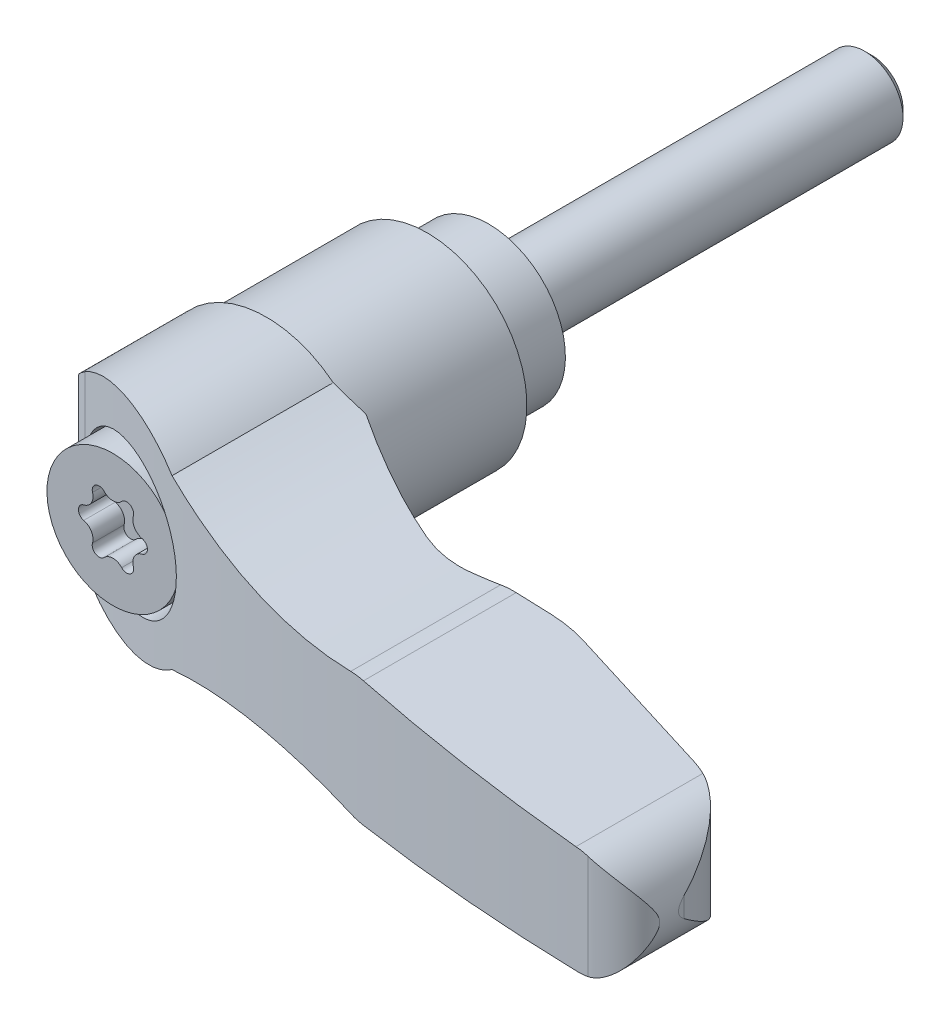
ISO-10303-21;
HEADER;
FILE_DESCRIPTION(('STEP AP214'),'2;1');
FILE_NAME('part.step','',(''),(''),'','','');
FILE_SCHEMA(('AUTOMOTIVE_DESIGN { 1 0 10303 214 1 1 1 1 }'));
ENDSEC;
DATA;
#1=APPLICATION_CONTEXT('core data for automotive mechanical design processes');
#2=APPLICATION_PROTOCOL_DEFINITION('international standard','automotive_design',2000,#1);
#3=PRODUCT_CONTEXT('',#1,'mechanical');
#4=PRODUCT('Part','Part','',(#3));
#5=PRODUCT_RELATED_PRODUCT_CATEGORY('part','',(#4));
#6=PRODUCT_DEFINITION_FORMATION('','',#4);
#7=PRODUCT_DEFINITION_CONTEXT('part definition',#1,'design');
#8=PRODUCT_DEFINITION('design','',#6,#7);
#9=PRODUCT_DEFINITION_SHAPE('','',#8);
#10=(LENGTH_UNIT() NAMED_UNIT(*) SI_UNIT(.MILLI.,.METRE.));
#11=(NAMED_UNIT(*) PLANE_ANGLE_UNIT() SI_UNIT($,.RADIAN.));
#12=(NAMED_UNIT(*) SI_UNIT($,.STERADIAN.) SOLID_ANGLE_UNIT());
#13=UNCERTAINTY_MEASURE_WITH_UNIT(LENGTH_MEASURE(1.E-05),#10,'distance_accuracy_value','');
#14=(GEOMETRIC_REPRESENTATION_CONTEXT(3) GLOBAL_UNCERTAINTY_ASSIGNED_CONTEXT((#13)) GLOBAL_UNIT_ASSIGNED_CONTEXT((#10,
#11,#12)) REPRESENTATION_CONTEXT('',''));
#15=CARTESIAN_POINT('',(0.,0.,0.));
#16=DIRECTION('',(0.,0.,1.));
#17=DIRECTION('',(1.,0.,0.));
#18=AXIS2_PLACEMENT_3D('',#15,#16,#17);
#19=CARTESIAN_POINT('',(0.,0.,-4.754266));
#20=DIRECTION('',(0.,0.,-1.));
#21=DIRECTION('',(0.,1.,0.));
#22=AXIS2_PLACEMENT_3D('',#19,#20,#21);
#23=CYLINDRICAL_SURFACE('',#22,2.5);
#24=CARTESIAN_POINT('',(0.,0.,-24.51));
#25=DIRECTION('',(0.,0.,-1.));
#26=DIRECTION('',(0.,1.,0.));
#27=AXIS2_PLACEMENT_3D('',#24,#25,#26);
#28=CIRCLE('',#27,2.5);
#29=CARTESIAN_POINT('',(0.,2.5,-24.51));
#30=VERTEX_POINT('',#29);
#31=EDGE_CURVE('E9',#30,#30,#28,.F.);
#32=ORIENTED_EDGE('',*,*,#31,.T.);
#33=EDGE_LOOP('',(#32));
#34=FACE_BOUND('',#33,.T.);
#35=CARTESIAN_POINT('',(0.,0.,0.));
#36=DIRECTION('',(0.,0.,-1.));
#37=DIRECTION('',(0.,1.,0.));
#38=AXIS2_PLACEMENT_3D('',#35,#36,#37);
#39=CIRCLE('',#38,2.5);
#40=CARTESIAN_POINT('',(0.,2.5,0.));
#41=VERTEX_POINT('',#40);
#42=EDGE_CURVE('E565',#41,#41,#39,.F.);
#43=ORIENTED_EDGE('',*,*,#42,.F.);
#44=EDGE_LOOP('',(#43));
#45=FACE_BOUND('',#44,.T.);
#46=ADVANCED_FACE('F14',(#34,#45),#23,.T.);
#47=CARTESIAN_POINT('',(3.75,0.,0.));
#48=DIRECTION('',(0.,0.,-1.));
#49=DIRECTION('',(0.,1.,0.));
#50=AXIS2_PLACEMENT_3D('',#47,#48,#49);
#51=PLANE('',#50);
#52=ORIENTED_EDGE('',*,*,#42,.T.);
#53=EDGE_LOOP('',(#52));
#54=FACE_BOUND('',#53,.T.);
#55=CARTESIAN_POINT('',(0.,0.,0.));
#56=DIRECTION('',(0.,0.,-1.));
#57=DIRECTION('',(0.,1.,0.));
#58=AXIS2_PLACEMENT_3D('',#55,#56,#57);
#59=CIRCLE('',#58,5.);
#60=CARTESIAN_POINT('',(0.,5.,0.));
#61=VERTEX_POINT('',#60);
#62=EDGE_CURVE('E725',#61,#61,#59,.F.);
#63=ORIENTED_EDGE('',*,*,#62,.F.);
#64=EDGE_LOOP('',(#63));
#65=FACE_BOUND('',#64,.T.);
#66=ADVANCED_FACE('F668',(#54,#65),#51,.T.);
#67=CARTESIAN_POINT('',(0.,0.,6.4));
#68=DIRECTION('',(0.,0.,-1.));
#69=DIRECTION('',(0.,1.,0.));
#70=AXIS2_PLACEMENT_3D('',#67,#68,#69);
#71=CYLINDRICAL_SURFACE('',#70,5.);
#72=ORIENTED_EDGE('',*,*,#62,.T.);
#73=EDGE_LOOP('',(#72));
#74=FACE_BOUND('',#73,.T.);
#75=CARTESIAN_POINT('',(0.,0.,4.55000000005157));
#76=DIRECTION('',(0.,0.,-1.));
#77=DIRECTION('',(1.,0.,0.));
#78=AXIS2_PLACEMENT_3D('',#75,#76,#77);
#79=CIRCLE('',#78,4.99999999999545);
#80=CARTESIAN_POINT('',(4.99999999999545,0.,4.55000000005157));
#81=VERTEX_POINT('',#80);
#82=EDGE_CURVE('E558',#81,#81,#79,.T.);
#83=ORIENTED_EDGE('',*,*,#82,.T.);
#84=EDGE_LOOP('',(#83));
#85=FACE_BOUND('',#84,.T.);
#86=ADVANCED_FACE('F675',(#74,#85),#71,.T.);
#87=CARTESIAN_POINT('',(0.,0.,4.30000000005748));
#88=DIRECTION('',(0.,0.,-1.));
#89=DIRECTION('',(0.,1.,0.));
#90=AXIS2_PLACEMENT_3D('',#87,#88,#89);
#91=CONICAL_SURFACE('',#90,5.24999999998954,0.785398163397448);
#92=ORIENTED_EDGE('',*,*,#82,.F.);
#93=EDGE_LOOP('',(#92));
#94=FACE_BOUND('',#93,.T.);
#95=CARTESIAN_POINT('',(0.,0.,4.3));
#96=DIRECTION('',(0.,0.,-1.));
#97=DIRECTION('',(0.,1.,0.));
#98=AXIS2_PLACEMENT_3D('',#95,#96,#97);
#99=CIRCLE('',#98,5.25);
#100=CARTESIAN_POINT('',(0.,5.25,4.3));
#101=VERTEX_POINT('',#100);
#102=EDGE_CURVE('E554',#101,#101,#99,.T.);
#103=ORIENTED_EDGE('',*,*,#102,.T.);
#104=EDGE_LOOP('',(#103));
#105=FACE_BOUND('',#104,.T.);
#106=ADVANCED_FACE('F683',(#94,#105),#91,.F.);
#107=CARTESIAN_POINT('',(0.,0.,3.65));
#108=DIRECTION('',(0.,0.,-1.));
#109=DIRECTION('',(0.,1.,0.));
#110=AXIS2_PLACEMENT_3D('',#107,#108,#109);
#111=CYLINDRICAL_SURFACE('',#110,5.25);
#112=ORIENTED_EDGE('',*,*,#102,.F.);
#113=EDGE_LOOP('',(#112));
#114=FACE_BOUND('',#113,.T.);
#115=CARTESIAN_POINT('',(0.,0.,4.));
#116=DIRECTION('',(0.,0.,-1.));
#117=DIRECTION('',(0.,1.,0.));
#118=AXIS2_PLACEMENT_3D('',#115,#116,#117);
#119=CIRCLE('',#118,5.25);
#120=CARTESIAN_POINT('',(0.,5.25,4.));
#121=VERTEX_POINT('',#120);
#122=EDGE_CURVE('E713',#121,#121,#119,.F.);
#123=ORIENTED_EDGE('',*,*,#122,.F.);
#124=EDGE_LOOP('',(#123));
#125=FACE_BOUND('',#124,.T.);
#126=ADVANCED_FACE('F690',(#114,#125),#111,.F.);
#127=CARTESIAN_POINT('',(-6.36002265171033,-14.,4.));
#128=DIRECTION('',(0.707106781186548,0.,0.707106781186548));
#129=DIRECTION('',(-0.707106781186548,0.,0.707106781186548));
#130=AXIS2_PLACEMENT_3D('',#127,#128,#129);
#131=PLANE('',#130);
#132=DIRECTION('',(0.,1.,0.));
#133=VECTOR('',#132,1.);
#134=CARTESIAN_POINT('',(-6.36002265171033,0.,4.));
#135=LINE('',#134,#133);
#136=CARTESIAN_POINT('',(-6.36002265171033,-1.38824072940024,4.));
#137=VERTEX_POINT('',#136);
#138=CARTESIAN_POINT('',(-6.36002265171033,1.38824072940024,4.));
#139=VERTEX_POINT('',#138);
#140=EDGE_CURVE('E715',#137,#139,#135,.T.);
#141=ORIENTED_EDGE('',*,*,#140,.F.);
#142=CARTESIAN_POINT('',(-0.0100000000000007,0.,-2.35002265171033));
#143=DIRECTION('',(0.707106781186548,0.,0.707106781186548));
#144=DIRECTION('',(-0.707106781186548,0.,0.707106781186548));
#145=AXIS2_PLACEMENT_3D('',#142,#143,#144);
#146=ELLIPSE('',#145,9.19238815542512,6.5);
#147=EDGE_CURVE('E557',#139,#137,#146,.T.);
#148=ORIENTED_EDGE('',*,*,#147,.F.);
#149=EDGE_LOOP('',(#141,#148));
#150=FACE_BOUND('',#149,.T.);
#151=ADVANCED_FACE('F694',(#150),#131,.F.);
#152=CARTESIAN_POINT('',(-3.26,0.,4.));
#153=DIRECTION('',(0.,0.,-1.));
#154=DIRECTION('',(0.,1.,0.));
#155=AXIS2_PLACEMENT_3D('',#152,#153,#154);
#156=PLANE('',#155);
#157=CARTESIAN_POINT('',(-0.00999999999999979,0.,4.));
#158=DIRECTION('',(0.,0.,1.));
#159=DIRECTION('',(-1.,0.,0.));
#160=AXIS2_PLACEMENT_3D('',#157,#158,#159);
#161=CIRCLE('',#160,6.5);
#162=EDGE_CURVE('E709',#137,#139,#161,.T.);
#163=ORIENTED_EDGE('',*,*,#162,.F.);
#164=ORIENTED_EDGE('',*,*,#140,.T.);
#165=EDGE_LOOP('',(#163,#164));
#166=FACE_BOUND('',#165,.T.);
#167=ORIENTED_EDGE('',*,*,#122,.T.);
#168=EDGE_LOOP('',(#167));
#169=FACE_BOUND('',#168,.T.);
#170=ADVANCED_FACE('F697',(#166,#169),#156,.T.);
#171=CARTESIAN_POINT('',(39.9389658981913,-8.,27.2042491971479));
#172=DIRECTION('',(0.989626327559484,0.,-0.143665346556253));
#173=DIRECTION('',(0.143665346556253,0.,0.989626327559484));
#174=AXIS2_PLACEMENT_3D('',#171,#172,#173);
#175=PLANE('',#174);
#176=CARTESIAN_POINT('',(36.5,0.,3.51522972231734));
#177=DIRECTION('',(0.989626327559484,0.,-0.143665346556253));
#178=DIRECTION('',(0.143665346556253,0.,0.989626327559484));
#179=AXIS2_PLACEMENT_3D('',#176,#177,#178);
#180=ELLIPSE('',#179,24.3621728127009,3.5);
#181=CARTESIAN_POINT('',(39.9389658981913,-0.650779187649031,27.2042491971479));
#182=VERTEX_POINT('',#181);
#183=CARTESIAN_POINT('',(39.9389658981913,0.650779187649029,27.2042491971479));
#184=VERTEX_POINT('',#183);
#185=EDGE_CURVE('E461',#182,#184,#180,.F.);
#186=ORIENTED_EDGE('',*,*,#185,.F.);
#187=DIRECTION('',(0.,-1.,0.));
#188=VECTOR('',#187,1.);
#189=CARTESIAN_POINT('',(39.9389658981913,-8.,27.2042491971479));
#190=LINE('',#189,#188);
#191=EDGE_CURVE('E848',#184,#182,#190,.T.);
#192=ORIENTED_EDGE('',*,*,#191,.F.);
#193=EDGE_LOOP('',(#186,#192));
#194=FACE_BOUND('',#193,.T.);
#195=ADVANCED_FACE('F485',(#194),#175,.T.);
#196=CARTESIAN_POINT('',(33.8626602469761,-8.,28.0863544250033));
#197=DIRECTION('',(0.,-1.,0.));
#198=DIRECTION('',(1.,0.,0.));
#199=AXIS2_PLACEMENT_3D('',#196,#197,#198);
#200=CYLINDRICAL_SURFACE('',#199,6.14);
#201=ORIENTED_EDGE('',*,*,#191,.T.);
#202=CARTESIAN_POINT('',(36.5,-3.5,22.5416236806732));
#203=CARTESIAN_POINT('',(36.6061539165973,-3.50000941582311,22.5920863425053));
#204=CARTESIAN_POINT('',(36.7107657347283,-3.49517280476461,22.6456099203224));
#205=CARTESIAN_POINT('',(36.9160027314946,-3.47671082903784,22.758101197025));
#206=CARTESIAN_POINT('',(37.0166343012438,-3.46310021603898,22.8170596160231));
#207=CARTESIAN_POINT('',(37.2123479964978,-3.42816986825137,22.9392782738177));
#208=CARTESIAN_POINT('',(37.3074768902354,-3.40693163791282,23.002487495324));
#209=CARTESIAN_POINT('',(37.4929223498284,-3.3575759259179,23.13320682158));
#210=CARTESIAN_POINT('',(37.5832363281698,-3.32945478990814,23.2007191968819));
#211=CARTESIAN_POINT('',(37.7830795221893,-3.25850520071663,23.358740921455));
#212=CARTESIAN_POINT('',(37.8909927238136,-3.21376078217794,23.4504360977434));
#213=CARTESIAN_POINT('',(38.0982482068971,-3.11588681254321,23.6389903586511));
#214=CARTESIAN_POINT('',(38.1975840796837,-3.06275107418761,23.7358532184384));
#215=CARTESIAN_POINT('',(38.3880468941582,-2.94917464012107,23.9343090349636));
#216=CARTESIAN_POINT('',(38.4791322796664,-2.88870020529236,24.0359224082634));
#217=CARTESIAN_POINT('',(38.6526412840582,-2.76182607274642,24.2426721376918));
#218=CARTESIAN_POINT('',(38.7350674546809,-2.69542813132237,24.3478074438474));
#219=CARTESIAN_POINT('',(38.9229341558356,-2.52996933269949,24.6038856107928));
#220=CARTESIAN_POINT('',(39.0243159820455,-2.42850340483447,24.7562617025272));
#221=CARTESIAN_POINT('',(39.2111706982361,-2.21796613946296,25.0654781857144));
#222=CARTESIAN_POINT('',(39.2966363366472,-2.10889136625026,25.2223205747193));
#223=CARTESIAN_POINT('',(39.452222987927,-1.88493092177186,25.5392893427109));
#224=CARTESIAN_POINT('',(39.5223498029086,-1.77004746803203,25.699414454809));
#225=CARTESIAN_POINT('',(39.6478320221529,-1.53583460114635,26.0220530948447));
#226=CARTESIAN_POINT('',(39.7031929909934,-1.41650688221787,26.1845656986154));
#227=CARTESIAN_POINT('',(39.7933776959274,-1.1901857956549,26.4900634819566));
#228=CARTESIAN_POINT('',(39.8299343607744,-1.08360162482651,26.6328455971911));
#229=CARTESIAN_POINT('',(39.8923391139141,-0.86858691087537,26.918504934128));
#230=CARTESIAN_POINT('',(39.918226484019,-0.76016469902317,27.0613798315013));
#231=CARTESIAN_POINT('',(39.9389658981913,-0.650779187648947,27.204249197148));
#232=B_SPLINE_CURVE_WITH_KNOTS('',3,(#202,#203,#204,#205,#206,#207,#208,#209,#210,#211,#212,
#213,#214,#215,#216,#217,#218,#219,#220,#221,#222,#223,#224,#225,#226,#227,#228,#229,#230,#231),
.UNSPECIFIED.,.F.,.F.,(4,2,2,2,2,2,2,2,2,2,2,2,2,2,4),(0.,0.352350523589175,0.704110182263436,
1.05221781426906,1.40051067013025,1.84538152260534,2.29058194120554,2.73791274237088,
3.18511134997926,3.81198117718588,4.43913591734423,5.06605301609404,5.69273352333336,
6.23807905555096,6.78139842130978),.UNSPECIFIED.);
#233=CARTESIAN_POINT('',(36.5,-3.5,22.5416236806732));
#234=VERTEX_POINT('',#233);
#235=EDGE_CURVE('E465',#234,#182,#232,.T.);
#236=ORIENTED_EDGE('',*,*,#235,.F.);
#237=CARTESIAN_POINT('',(33.8626602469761,-3.59762871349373,28.0863544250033));
#238=DIRECTION('',(-0.0369925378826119,0.999315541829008,0.));
#239=DIRECTION('',(-0.999315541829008,-0.0369925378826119,0.));
#240=AXIS2_PLACEMENT_3D('',#237,#238,#239);
#241=ELLIPSE('',#240,6.14420545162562,6.14);
#242=CARTESIAN_POINT('',(35.5344609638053,-3.53574220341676,22.1783359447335));
#243=VERTEX_POINT('',#242);
#244=EDGE_CURVE('E717',#234,#243,#241,.T.);
#245=ORIENTED_EDGE('',*,*,#244,.T.);
#246=DIRECTION('',(0.,-1.,0.));
#247=VECTOR('',#246,1.);
#248=CARTESIAN_POINT('',(35.5344609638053,-8.,22.1783359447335));
#249=LINE('',#248,#247);
#250=CARTESIAN_POINT('',(35.5344609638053,3.53574220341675,22.1783359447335));
#251=VERTEX_POINT('',#250);
#252=EDGE_CURVE('E539',#251,#243,#249,.T.);
#253=ORIENTED_EDGE('',*,*,#252,.F.);
#254=CARTESIAN_POINT('',(33.8626602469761,3.59762871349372,28.0863544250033));
#255=DIRECTION('',(-0.036992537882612,-0.999315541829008,0.));
#256=DIRECTION('',(0.999315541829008,-0.036992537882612,0.));
#257=AXIS2_PLACEMENT_3D('',#254,#255,#256);
#258=ELLIPSE('',#257,6.14420545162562,6.14);
#259=CARTESIAN_POINT('',(36.5,3.5,22.5416236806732));
#260=VERTEX_POINT('',#259);
#261=EDGE_CURVE('E847',#251,#260,#258,.T.);
#262=ORIENTED_EDGE('',*,*,#261,.T.);
#263=CARTESIAN_POINT('',(39.9389658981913,0.65077918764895,27.204249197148));
#264=CARTESIAN_POINT('',(39.9247028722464,0.726086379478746,27.1059853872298));
#265=CARTESIAN_POINT('',(39.9079968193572,0.800887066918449,27.0076860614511));
#266=CARTESIAN_POINT('',(39.8696347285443,0.949458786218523,26.8112602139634));
#267=CARTESIAN_POINT('',(39.8479781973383,1.02322971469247,26.7131337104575));
#268=CARTESIAN_POINT('',(39.7995979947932,1.169880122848,26.5170899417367));
#269=CARTESIAN_POINT('',(39.7728626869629,1.24275713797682,26.4191736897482));
#270=CARTESIAN_POINT('',(39.7142815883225,1.38725410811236,26.2239599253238));
#271=CARTESIAN_POINT('',(39.6824358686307,1.4588740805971,26.1266624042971));
#272=CARTESIAN_POINT('',(39.5782917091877,1.67318502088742,25.8337016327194));
#273=CARTESIAN_POINT('',(39.4979263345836,1.81366367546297,25.6391889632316));
#274=CARTESIAN_POINT('',(39.3150854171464,2.08619457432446,25.2551202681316));
#275=CARTESIAN_POINT('',(39.2126344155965,2.218255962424,25.0655590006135));
#276=CARTESIAN_POINT('',(38.9595027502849,2.49877334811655,24.6523338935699));
#277=CARTESIAN_POINT('',(38.8031801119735,2.64456339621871,24.4302018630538));
#278=CARTESIAN_POINT('',(38.5417124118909,2.84488994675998,24.1082756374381));
#279=CARTESIAN_POINT('',(38.4501831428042,2.90854134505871,24.0029632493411));
#280=CARTESIAN_POINT('',(38.2579442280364,3.02861213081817,23.7967186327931));
#281=CARTESIAN_POINT('',(38.1572360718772,3.08503268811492,23.6957856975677));
#282=CARTESIAN_POINT('',(37.8892625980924,3.21757634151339,23.4457323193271));
#283=CARTESIAN_POINT('',(37.7155213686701,3.28779061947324,23.3001643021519));
#284=CARTESIAN_POINT('',(37.4396992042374,3.37286339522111,23.0946053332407));
#285=CARTESIAN_POINT('',(37.3453175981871,3.39783246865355,23.0282732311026));
#286=CARTESIAN_POINT('',(37.1517842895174,3.44019984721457,22.9003457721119));
#287=CARTESIAN_POINT('',(37.0526354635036,3.45760265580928,22.8387476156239));
#288=CARTESIAN_POINT('',(36.8781783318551,3.48029211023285,22.7372021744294));
#289=CARTESIAN_POINT('',(36.8038676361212,3.48759914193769,22.6959814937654));
#290=CARTESIAN_POINT('',(36.6533047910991,3.497455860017,22.6165121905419));
#291=CARTESIAN_POINT('',(36.5770513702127,3.50000234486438,22.5782655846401));
#292=CARTESIAN_POINT('',(36.5,3.5,22.5416236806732));
#293=B_SPLINE_CURVE_WITH_KNOTS('',3,(#263,#264,#265,#266,#267,#268,#269,#270,#271,#272,#273,
#274,#275,#276,#277,#278,#279,#280,#281,#282,#283,#284,#285,#286,#287,#288,#289,#290,#291,#292),
.UNSPECIFIED.,.F.,.F.,(4,2,2,2,2,2,2,2,2,2,2,2,2,2,4),(0.,0.373839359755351,0.747715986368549,
1.12245980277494,1.49719840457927,2.25512351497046,3.01221072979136,3.93367725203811,
4.39332639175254,4.85290107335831,5.56171222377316,5.91546495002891,6.26900683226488,
6.52468766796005,6.78054039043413),.UNSPECIFIED.);
#294=EDGE_CURVE('E434',#184,#260,#293,.T.);
#295=ORIENTED_EDGE('',*,*,#294,.F.);
#296=EDGE_LOOP('',(#201,#236,#245,#253,#262,#295));
#297=FACE_BOUND('',#296,.T.);
#298=ADVANCED_FACE('F479',(#297),#200,.T.);
#299=CARTESIAN_POINT('',(-0.0099999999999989,0.,10.28125));
#300=DIRECTION('',(0.,0.,1.));
#301=DIRECTION('',(-1.,0.,0.));
#302=AXIS2_PLACEMENT_3D('',#299,#300,#301);
#303=CYLINDRICAL_SURFACE('',#302,6.5);
#304=CARTESIAN_POINT('',(-0.00999999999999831,0.,14.5));
#305=DIRECTION('',(0.,0.,1.));
#306=DIRECTION('',(-1.,0.,0.));
#307=AXIS2_PLACEMENT_3D('',#304,#305,#306);
#308=CIRCLE('',#307,6.5);
#309=CARTESIAN_POINT('',(-6.51,0.,14.5));
#310=VERTEX_POINT('',#309);
#311=CARTESIAN_POINT('',(6.49,0.,14.5));
#312=VERTEX_POINT('',#311);
#313=EDGE_CURVE('E850',#310,#312,#308,.T.);
#314=ORIENTED_EDGE('',*,*,#313,.F.);
#315=CARTESIAN_POINT('',(-0.00999999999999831,0.,14.5));
#316=DIRECTION('',(0.,0.,1.));
#317=DIRECTION('',(-1.,0.,0.));
#318=AXIS2_PLACEMENT_3D('',#315,#316,#317);
#319=CIRCLE('',#318,6.5);
#320=EDGE_CURVE('E536',#312,#310,#319,.T.);
#321=ORIENTED_EDGE('',*,*,#320,.F.);
#322=EDGE_LOOP('',(#314,#321));
#323=FACE_BOUND('',#322,.T.);
#324=ORIENTED_EDGE('',*,*,#162,.T.);
#325=ORIENTED_EDGE('',*,*,#147,.T.);
#326=EDGE_LOOP('',(#324,#325));
#327=FACE_BOUND('',#326,.T.);
#328=ADVANCED_FACE('F484',(#323,#327),#303,.T.);
#329=CARTESIAN_POINT('',(-6.51,-8.,14.5));
#330=DIRECTION('',(0.,0.,-1.));
#331=DIRECTION('',(0.,1.,0.));
#332=AXIS2_PLACEMENT_3D('',#329,#330,#331);
#333=PLANE('',#332);
#334=ORIENTED_EDGE('',*,*,#313,.T.);
#335=DIRECTION('',(0.,-1.,0.));
#336=VECTOR('',#335,1.);
#337=CARTESIAN_POINT('',(6.49,-8.,14.5));
#338=LINE('',#337,#336);
#339=CARTESIAN_POINT('',(6.49,-4.77390244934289,14.5));
#340=VERTEX_POINT('',#339);
#341=EDGE_CURVE('E853',#312,#340,#338,.T.);
#342=ORIENTED_EDGE('',*,*,#341,.T.);
#343=CARTESIAN_POINT('',(14.8,-33.6,14.5));
#344=DIRECTION('',(0.,0.,1.));
#345=DIRECTION('',(0.,-1.,0.));
#346=AXIS2_PLACEMENT_3D('',#343,#344,#345);
#347=CIRCLE('',#346,30.);
#348=CARTESIAN_POINT('',(4.36278582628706,-5.47413005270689,14.5));
#349=VERTEX_POINT('',#348);
#350=EDGE_CURVE('E810',#340,#349,#347,.T.);
#351=ORIENTED_EDGE('',*,*,#350,.T.);
#352=CARTESIAN_POINT('',(0.,0.,14.5));
#353=DIRECTION('',(0.,0.,1.));
#354=DIRECTION('',(0.,-1.,0.));
#355=AXIS2_PLACEMENT_3D('',#352,#353,#354);
#356=CIRCLE('',#355,7.);
#357=CARTESIAN_POINT('',(-6.51,-2.57291663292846,14.5));
#358=VERTEX_POINT('',#357);
#359=EDGE_CURVE('E372',#358,#349,#356,.T.);
#360=ORIENTED_EDGE('',*,*,#359,.F.);
#361=DIRECTION('',(0.,-1.,0.));
#362=VECTOR('',#361,1.);
#363=CARTESIAN_POINT('',(-6.51,-8.,14.5));
#364=LINE('',#363,#362);
#365=EDGE_CURVE('E535',#310,#358,#364,.T.);
#366=ORIENTED_EDGE('',*,*,#365,.F.);
#367=EDGE_LOOP('',(#334,#342,#351,#360,#366));
#368=FACE_BOUND('',#367,.T.);
#369=ADVANCED_FACE('F490',(#368),#333,.T.);
#370=CARTESIAN_POINT('',(20.6060580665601,0.915064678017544,31.));
#371=DIRECTION('',(0.,0.,1.));
#372=DIRECTION('',(0.,-1.,0.));
#373=AXIS2_PLACEMENT_3D('',#370,#371,#372);
#374=CYLINDRICAL_SURFACE('',#373,5.);
#375=CARTESIAN_POINT('',(20.7910207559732,-4.08151303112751,28.9575923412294));
#376=CARTESIAN_POINT('',(20.6207575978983,-4.08776311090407,28.9275070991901));
#377=CARTESIAN_POINT('',(20.4510927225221,-4.08540030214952,28.8972050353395));
#378=CARTESIAN_POINT('',(20.1129595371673,-4.06344890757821,28.8361672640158));
#379=CARTESIAN_POINT('',(19.9444912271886,-4.04386032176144,28.8054315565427));
#380=CARTESIAN_POINT('',(19.7766211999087,-4.01565884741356,28.7744790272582));
#381=B_SPLINE_CURVE_WITH_KNOTS('',3,(#375,#376,#377,#378,#379,#380),.UNSPECIFIED.,.F.,.F.,(4,2,
4),(0.,0.517097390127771,1.03419478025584),.UNSPECIFIED.);
#382=CARTESIAN_POINT('',(20.7910207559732,-4.08151303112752,28.9575923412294));
#383=VERTEX_POINT('',#382);
#384=CARTESIAN_POINT('',(19.7766211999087,-4.01565884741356,28.7744790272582));
#385=VERTEX_POINT('',#384);
#386=EDGE_CURVE('E468',#383,#385,#381,.T.);
#387=ORIENTED_EDGE('',*,*,#386,.T.);
#388=DIRECTION('',(0.,0.,1.));
#389=VECTOR('',#388,1.);
#390=CARTESIAN_POINT('',(19.7766211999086,-4.01565884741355,31.));
#391=LINE('',#390,#389);
#392=CARTESIAN_POINT('',(19.7766211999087,-4.01565884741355,19.));
#393=VERTEX_POINT('',#392);
#394=EDGE_CURVE('E803',#385,#393,#391,.F.);
#395=ORIENTED_EDGE('',*,*,#394,.T.);
#396=CARTESIAN_POINT('',(20.6060580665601,0.915064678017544,19.));
#397=DIRECTION('',(0.,0.,1.));
#398=DIRECTION('',(0.,-1.,0.));
#399=AXIS2_PLACEMENT_3D('',#396,#397,#398);
#400=CIRCLE('',#399,5.);
#401=CARTESIAN_POINT('',(20.7910207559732,-4.08151303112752,19.));
#402=VERTEX_POINT('',#401);
#403=EDGE_CURVE('E857',#402,#393,#400,.F.);
#404=ORIENTED_EDGE('',*,*,#403,.F.);
#405=DIRECTION('',(0.,0.,1.));
#406=VECTOR('',#405,1.);
#407=CARTESIAN_POINT('',(20.7910207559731,-4.08151303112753,31.));
#408=LINE('',#407,#406);
#409=EDGE_CURVE('E809',#402,#383,#408,.T.);
#410=ORIENTED_EDGE('',*,*,#409,.T.);
#411=EDGE_LOOP('',(#387,#395,#404,#410));
#412=FACE_BOUND('',#411,.T.);
#413=ADVANCED_FACE('F426',(#412),#374,.T.);
#414=CARTESIAN_POINT('',(36.5,0.,31.));
#415=DIRECTION('',(0.,0.,1.));
#416=DIRECTION('',(0.,-1.,0.));
#417=AXIS2_PLACEMENT_3D('',#414,#415,#416);
#418=CYLINDRICAL_SURFACE('',#417,3.5);
#419=CARTESIAN_POINT('',(37.3240183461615,-3.40161634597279,30.8631619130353));
#420=CARTESIAN_POINT('',(37.188603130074,-3.43435641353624,30.8557619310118));
#421=CARTESIAN_POINT('',(37.0522273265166,-3.45892508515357,30.8481012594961));
#422=CARTESIAN_POINT('',(36.7775545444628,-3.49171963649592,30.8322585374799));
#423=CARTESIAN_POINT('',(36.6392575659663,-3.499945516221,30.8240764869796));
#424=CARTESIAN_POINT('',(36.5,-3.5,30.815633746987));
#425=B_SPLINE_CURVE_WITH_KNOTS('',3,(#419,#420,#421,#422,#423,#424),.UNSPECIFIED.,.F.,.F.,(4,2,
4),(0.,0.416348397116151,0.832696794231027),.UNSPECIFIED.);
#426=CARTESIAN_POINT('',(37.3240183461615,-3.40161634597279,30.8631619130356));
#427=VERTEX_POINT('',#426);
#428=CARTESIAN_POINT('',(36.5,-3.5,30.815633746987));
#429=VERTEX_POINT('',#428);
#430=EDGE_CURVE('E446',#427,#429,#425,.T.);
#431=ORIENTED_EDGE('',*,*,#430,.T.);
#432=DIRECTION('',(0.,0.,1.));
#433=VECTOR('',#432,1.);
#434=CARTESIAN_POINT('',(36.5,-3.5,31.));
#435=LINE('',#434,#433);
#436=EDGE_CURVE('E820',#429,#234,#435,.F.);
#437=ORIENTED_EDGE('',*,*,#436,.T.);
#438=ORIENTED_EDGE('',*,*,#235,.T.);
#439=ORIENTED_EDGE('',*,*,#185,.T.);
#440=ORIENTED_EDGE('',*,*,#294,.T.);
#441=DIRECTION('',(0.,0.,1.));
#442=VECTOR('',#441,1.);
#443=CARTESIAN_POINT('',(36.5,3.5,31.));
#444=LINE('',#443,#442);
#445=CARTESIAN_POINT('',(36.5,3.5,30.815633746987));
#446=VERTEX_POINT('',#445);
#447=EDGE_CURVE('E414',#260,#446,#444,.T.);
#448=ORIENTED_EDGE('',*,*,#447,.T.);
#449=CARTESIAN_POINT('',(36.5,3.5,30.815633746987));
#450=CARTESIAN_POINT('',(36.6392575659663,3.499945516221,30.8240764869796));
#451=CARTESIAN_POINT('',(36.7775545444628,3.49171963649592,30.8322585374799));
#452=CARTESIAN_POINT('',(37.0522273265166,3.45892508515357,30.8481012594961));
#453=CARTESIAN_POINT('',(37.188603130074,3.43435641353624,30.8557619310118));
#454=CARTESIAN_POINT('',(37.3240183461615,3.40161634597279,30.8631619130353));
#455=B_SPLINE_CURVE_WITH_KNOTS('',3,(#449,#450,#451,#452,#453,#454),.UNSPECIFIED.,.F.,.F.,(4,2,
4),(0.,0.416348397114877,0.832696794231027),.UNSPECIFIED.);
#456=CARTESIAN_POINT('',(37.3240183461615,3.40161634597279,30.8631619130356));
#457=VERTEX_POINT('',#456);
#458=EDGE_CURVE('E452',#446,#457,#455,.T.);
#459=ORIENTED_EDGE('',*,*,#458,.T.);
#460=CARTESIAN_POINT('',(37.3240183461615,-3.40161634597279,30.8631619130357));
#461=CARTESIAN_POINT('',(37.391971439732,-3.38517327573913,30.8668921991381));
#462=CARTESIAN_POINT('',(37.4595366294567,-3.36663320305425,30.8678982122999));
#463=CARTESIAN_POINT('',(37.5932555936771,-3.32560440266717,30.8647814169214));
#464=CARTESIAN_POINT('',(37.6594109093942,-3.30312026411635,30.8606645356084));
#465=CARTESIAN_POINT('',(37.7892420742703,-3.25463078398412,30.8476880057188));
#466=CARTESIAN_POINT('',(37.8529349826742,-3.22865926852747,30.8388717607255));
#467=CARTESIAN_POINT('',(37.9780608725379,-3.17332967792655,30.8169101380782));
#468=CARTESIAN_POINT('',(38.0394932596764,-3.14397072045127,30.8037636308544));
#469=CARTESIAN_POINT('',(38.2193405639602,-3.05154774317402,30.7585650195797));
#470=CARTESIAN_POINT('',(38.3339861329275,-2.98387991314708,30.7206782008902));
#471=CARTESIAN_POINT('',(38.5517467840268,-2.83858348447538,30.6324207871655));
#472=CARTESIAN_POINT('',(38.6548343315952,-2.76093200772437,30.5820212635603));
#473=CARTESIAN_POINT('',(38.8266237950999,-2.61655584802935,30.4842690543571));
#474=CARTESIAN_POINT('',(38.8977926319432,-2.55140368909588,30.4388637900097));
#475=CARTESIAN_POINT('',(39.0330318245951,-2.41719472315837,30.3433991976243));
#476=CARTESIAN_POINT('',(39.0970985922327,-2.34813596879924,30.2933375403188));
#477=CARTESIAN_POINT('',(39.2184581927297,-2.20651617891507,30.1893556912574));
#478=CARTESIAN_POINT('',(39.2757265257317,-2.13394372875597,30.1354226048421));
#479=CARTESIAN_POINT('',(39.3834200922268,-1.9860149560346,30.0247265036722));
#480=CARTESIAN_POINT('',(39.4338475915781,-1.91065956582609,29.9679644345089));
#481=CARTESIAN_POINT('',(39.542421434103,-1.73419420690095,29.8348143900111));
#482=CARTESIAN_POINT('',(39.598263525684,-1.63221056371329,29.7576996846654));
#483=CARTESIAN_POINT('',(39.699250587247,-1.42414609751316,29.601672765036));
#484=CARTESIAN_POINT('',(39.7443776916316,-1.31805876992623,29.5227577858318));
#485=CARTESIAN_POINT('',(39.8239747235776,-1.10201279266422,29.3659397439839));
#486=CARTESIAN_POINT('',(39.8584944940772,-0.992075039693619,29.2880336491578));
#487=CARTESIAN_POINT('',(39.9024720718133,-0.82253324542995,29.1754655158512));
#488=CARTESIAN_POINT('',(39.9158188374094,-0.765322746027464,29.13870216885));
#489=CARTESIAN_POINT('',(39.9398686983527,-0.648731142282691,29.0678855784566));
#490=CARTESIAN_POINT('',(39.9505741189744,-0.589352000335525,29.0338299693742));
#491=CARTESIAN_POINT('',(39.9677206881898,-0.477086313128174,28.9756719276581));
#492=CARTESIAN_POINT('',(39.974567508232,-0.424644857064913,28.9508463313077));
#493=CARTESIAN_POINT('',(39.9860225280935,-0.317100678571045,28.907341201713));
#494=CARTESIAN_POINT('',(39.9906385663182,-0.262008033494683,28.8886402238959));
#495=CARTESIAN_POINT('',(39.9966232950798,-0.160247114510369,28.8637621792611));
#496=CARTESIAN_POINT('',(39.9984523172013,-0.114054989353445,28.8558445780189));
#497=CARTESIAN_POINT('',(40.0002450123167,-0.0209847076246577,28.8480882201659));
#498=CARTESIAN_POINT('',(40.0002117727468,0.0258921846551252,28.8482360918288));
#499=CARTESIAN_POINT('',(39.9982952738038,0.118672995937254,28.8565205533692));
#500=CARTESIAN_POINT('',(39.9964185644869,0.164579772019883,28.8646288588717));
#501=CARTESIAN_POINT('',(39.9910078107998,0.254792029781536,28.8870889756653));
#502=CARTESIAN_POINT('',(39.9874686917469,0.299092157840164,28.9014598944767));
#503=CARTESIAN_POINT('',(39.9768286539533,0.407331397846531,28.9425912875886));
#504=CARTESIAN_POINT('',(39.9688318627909,0.470155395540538,28.9719647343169));
#505=CARTESIAN_POINT('',(39.9499914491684,0.592804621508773,29.0357410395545));
#506=CARTESIAN_POINT('',(39.9391403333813,0.652621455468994,29.0701570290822));
#507=CARTESIAN_POINT('',(39.9146680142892,0.770512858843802,29.1419527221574));
#508=CARTESIAN_POINT('',(39.9010255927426,0.828569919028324,29.1793537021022));
#509=CARTESIAN_POINT('',(39.8711029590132,0.942947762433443,29.2555520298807));
#510=CARTESIAN_POINT('',(39.8548256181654,0.999270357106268,29.2943478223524));
#511=CARTESIAN_POINT('',(39.8016739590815,1.1674299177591,29.4125134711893));
#512=CARTESIAN_POINT('',(39.7607265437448,1.27728939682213,29.4929030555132));
#513=CARTESIAN_POINT('',(39.6677865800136,1.49294867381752,29.6529500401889));
#514=CARTESIAN_POINT('',(39.6157834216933,1.59874445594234,29.7326066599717));
#515=CARTESIAN_POINT('',(39.5005966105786,1.80564912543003,29.8886982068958));
#516=CARTESIAN_POINT('',(39.4374685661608,1.90677830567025,29.9651469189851));
#517=CARTESIAN_POINT('',(39.2994325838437,2.10420227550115,30.1133265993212));
#518=CARTESIAN_POINT('',(39.2245348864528,2.20050117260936,30.1850615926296));
#519=CARTESIAN_POINT('',(39.0442952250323,2.40820732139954,30.3372677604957));
#520=CARTESIAN_POINT('',(38.9358891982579,2.51819093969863,30.4161164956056));
#521=CARTESIAN_POINT('',(38.7000552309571,2.72661786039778,30.559662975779));
#522=CARTESIAN_POINT('',(38.5726400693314,2.82506883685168,30.6243701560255));
#523=CARTESIAN_POINT('',(38.3254291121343,2.98922527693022,30.7237895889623));
#524=CARTESIAN_POINT('',(38.2087731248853,3.05759969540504,30.7618633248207));
#525=CARTESIAN_POINT('',(37.9650872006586,3.18151973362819,30.8217517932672));
#526=CARTESIAN_POINT('',(37.8380870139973,3.23710049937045,30.8436114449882));
#527=CARTESIAN_POINT('',(37.6449762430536,3.3080955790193,30.8616374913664));
#528=CARTESIAN_POINT('',(37.5816159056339,3.32934954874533,30.8652564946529));
#529=CARTESIAN_POINT('',(37.4536360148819,3.36824327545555,30.867801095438));
#530=CARTESIAN_POINT('',(37.389015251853,3.38587935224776,30.8667219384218));
#531=CARTESIAN_POINT('',(37.3240183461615,3.40161634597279,30.8631619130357));
#532=B_SPLINE_CURVE_WITH_KNOTS('',3,(#460,#461,#462,#463,#464,#465,#466,#467,#468,#469,#470,
#471,#472,#473,#474,#475,#476,#477,#478,#479,#480,#481,#482,#483,#484,#485,#486,#487,#488,#489,
#490,#491,#492,#493,#494,#495,#496,#497,#498,#499,#500,#501,#502,#503,#504,#505,#506,#507,#508,
#509,#510,#511,#512,#513,#514,#515,#516,#517,#518,#519,#520,#521,#522,#523,#524,#525,#526,#527,
#528,#529,#530,#531),.UNSPECIFIED.,.F.,.F.,(4,2,2,2,2,2,2,2,2,2,2,2,2,2,2,2,2,2,2,2,2,2,2,2,2,2,
2,2,2,2,2,2,2,2,2,4),(0.,0.20991378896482,0.419584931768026,0.62735226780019,0.83517384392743,
1.2486492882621,1.66308971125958,1.98257890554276,2.30222878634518,2.62299771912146,
2.94366014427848,3.36167065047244,3.78037330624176,4.19707731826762,4.40489951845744,
4.61253810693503,4.78756393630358,4.9619702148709,5.10204921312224,5.24189598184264,
5.38124764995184,5.52102749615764,5.72989301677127,5.9393124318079,6.15038720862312,
6.36123350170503,6.7871576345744,7.21349237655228,7.63775356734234,8.06164764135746,
8.58013018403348,9.09826573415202,9.51811060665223,9.9367879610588,10.1373304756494,
10.3380759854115),.UNSPECIFIED.);
#533=EDGE_CURVE('E406',#427,#457,#532,.T.);
#534=ORIENTED_EDGE('',*,*,#533,.F.);
#535=EDGE_LOOP('',(#431,#437,#438,#439,#440,#448,#459,#534));
#536=FACE_BOUND('',#535,.T.);
#537=ADVANCED_FACE('F420',(#536),#418,.T.);
#538=CARTESIAN_POINT('',(23.0466685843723,-8.,28.05));
#539=DIRECTION('',(0.,-1.,0.));
#540=DIRECTION('',(1.,0.,0.));
#541=AXIS2_PLACEMENT_3D('',#538,#539,#540);
#542=CYLINDRICAL_SURFACE('',#541,9.05000000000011);
#543=CARTESIAN_POINT('',(23.0466685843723,3.99801374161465,28.05));
#544=DIRECTION('',(-0.036992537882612,-0.999315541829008,0.));
#545=DIRECTION('',(0.999315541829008,-0.036992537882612,0.));
#546=AXIS2_PLACEMENT_3D('',#543,#544,#545);
#547=ELLIPSE('',#546,9.05619858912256,9.05000000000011);
#548=CARTESIAN_POINT('',(23.0466685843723,3.99801374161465,19.));
#549=VERTEX_POINT('',#548);
#550=CARTESIAN_POINT('',(25.5108048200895,3.90679665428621,19.34192715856));
#551=VERTEX_POINT('',#550);
#552=EDGE_CURVE('E402',#549,#551,#547,.T.);
#553=ORIENTED_EDGE('',*,*,#552,.T.);
#554=DIRECTION('',(0.,-1.,0.));
#555=VECTOR('',#554,1.);
#556=CARTESIAN_POINT('',(25.5108048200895,-8.,19.34192715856));
#557=LINE('',#556,#555);
#558=CARTESIAN_POINT('',(25.5108048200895,-3.90679665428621,19.34192715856));
#559=VERTEX_POINT('',#558);
#560=EDGE_CURVE('E459',#559,#551,#557,.F.);
#561=ORIENTED_EDGE('',*,*,#560,.F.);
#562=CARTESIAN_POINT('',(23.0466685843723,-3.99801374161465,28.05));
#563=DIRECTION('',(-0.0369925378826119,0.999315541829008,0.));
#564=DIRECTION('',(-0.999315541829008,-0.0369925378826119,0.));
#565=AXIS2_PLACEMENT_3D('',#562,#563,#564);
#566=ELLIPSE('',#565,9.05619858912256,9.05000000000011);
#567=CARTESIAN_POINT('',(23.0466685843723,-3.99801374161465,19.));
#568=VERTEX_POINT('',#567);
#569=EDGE_CURVE('E416',#559,#568,#566,.T.);
#570=ORIENTED_EDGE('',*,*,#569,.T.);
#571=DIRECTION('',(0.,1.,0.));
#572=VECTOR('',#571,1.);
#573=CARTESIAN_POINT('',(23.0466685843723,-8.,19.));
#574=LINE('',#573,#572);
#575=EDGE_CURVE('E543',#549,#568,#574,.F.);
#576=ORIENTED_EDGE('',*,*,#575,.F.);
#577=EDGE_LOOP('',(#553,#561,#570,#576));
#578=FACE_BOUND('',#577,.T.);
#579=ADVANCED_FACE('F425',(#578),#542,.T.);
#580=CARTESIAN_POINT('',(25.5108048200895,-8.,19.34192715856));
#581=DIRECTION('',(0.272280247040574,0.,-0.962217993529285));
#582=DIRECTION('',(0.962217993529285,0.,0.272280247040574));
#583=AXIS2_PLACEMENT_3D('',#580,#581,#582);
#584=PLANE('',#583);
#585=DIRECTION('',(0.961608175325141,-0.0355966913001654,0.272107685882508));
#586=VECTOR('',#585,1.);
#587=CARTESIAN_POINT('',(25.5108048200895,3.90679665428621,19.34192715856));
#588=LINE('',#587,#586);
#589=EDGE_CURVE('E404',#551,#251,#588,.T.);
#590=ORIENTED_EDGE('',*,*,#589,.T.);
#591=ORIENTED_EDGE('',*,*,#252,.T.);
#592=DIRECTION('',(-0.961608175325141,-0.0355966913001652,-0.272107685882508));
#593=VECTOR('',#592,1.);
#594=CARTESIAN_POINT('',(35.5344609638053,-3.53574220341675,22.1783359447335));
#595=LINE('',#594,#593);
#596=EDGE_CURVE('E817',#243,#559,#595,.T.);
#597=ORIENTED_EDGE('',*,*,#596,.T.);
#598=ORIENTED_EDGE('',*,*,#560,.T.);
#599=EDGE_LOOP('',(#590,#591,#597,#598));
#600=FACE_BOUND('',#599,.T.);
#601=ADVANCED_FACE('F875',(#600),#584,.T.);
#602=CARTESIAN_POINT('',(20.60605806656,-0.915064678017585,31.));
#603=DIRECTION('',(0.,0.,1.));
#604=DIRECTION('',(0.,-1.,0.));
#605=AXIS2_PLACEMENT_3D('',#602,#603,#604);
#606=CYLINDRICAL_SURFACE('',#605,5.00000000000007);
#607=CARTESIAN_POINT('',(19.7766211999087,4.01565884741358,28.7744790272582));
#608=CARTESIAN_POINT('',(19.9444912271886,4.04386032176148,28.8054315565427));
#609=CARTESIAN_POINT('',(20.1129595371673,4.06344890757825,28.8361672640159));
#610=CARTESIAN_POINT('',(20.4510927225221,4.08540030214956,28.8972050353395));
#611=CARTESIAN_POINT('',(20.6207575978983,4.08776311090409,28.9275070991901));
#612=CARTESIAN_POINT('',(20.7910207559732,4.08151303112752,28.9575923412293));
#613=B_SPLINE_CURVE_WITH_KNOTS('',3,(#607,#608,#609,#610,#611,#612),.UNSPECIFIED.,.F.,.F.,(4,2,
4),(0.,0.517097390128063,1.03419478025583),.UNSPECIFIED.);
#614=CARTESIAN_POINT('',(19.7766211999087,4.01565884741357,28.7744790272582));
#615=VERTEX_POINT('',#614);
#616=CARTESIAN_POINT('',(20.7910207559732,4.08151303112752,28.9575923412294));
#617=VERTEX_POINT('',#616);
#618=EDGE_CURVE('E542',#615,#617,#613,.T.);
#619=ORIENTED_EDGE('',*,*,#618,.T.);
#620=DIRECTION('',(0.,0.,1.));
#621=VECTOR('',#620,1.);
#622=CARTESIAN_POINT('',(20.7910207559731,4.08151303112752,31.));
#623=LINE('',#622,#621);
#624=CARTESIAN_POINT('',(20.7910207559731,4.08151303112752,19.));
#625=VERTEX_POINT('',#624);
#626=EDGE_CURVE('E828',#617,#625,#623,.F.);
#627=ORIENTED_EDGE('',*,*,#626,.T.);
#628=CARTESIAN_POINT('',(20.60605806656,-0.915064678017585,19.));
#629=DIRECTION('',(0.,0.,1.));
#630=DIRECTION('',(0.,-1.,0.));
#631=AXIS2_PLACEMENT_3D('',#628,#629,#630);
#632=CIRCLE('',#631,5.00000000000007);
#633=CARTESIAN_POINT('',(19.7766211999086,4.01565884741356,19.));
#634=VERTEX_POINT('',#633);
#635=EDGE_CURVE('E547',#634,#625,#632,.F.);
#636=ORIENTED_EDGE('',*,*,#635,.F.);
#637=DIRECTION('',(0.,0.,1.));
#638=VECTOR('',#637,1.);
#639=CARTESIAN_POINT('',(19.7766211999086,4.01565884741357,31.));
#640=LINE('',#639,#638);
#641=EDGE_CURVE('E401',#634,#615,#640,.T.);
#642=ORIENTED_EDGE('',*,*,#641,.T.);
#643=EDGE_LOOP('',(#619,#627,#636,#642));
#644=FACE_BOUND('',#643,.T.);
#645=ADVANCED_FACE('F872',(#644),#606,.T.);
#646=CARTESIAN_POINT('',(42.8289340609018,-8.,-49.9630271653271));
#647=DIRECTION('',(0.,-1.,0.));
#648=DIRECTION('',(1.,0.,0.));
#649=AXIS2_PLACEMENT_3D('',#646,#647,#648);
#650=CYLINDRICAL_SURFACE('',#649,74.0000000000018);
#651=DIRECTION('',(0.,-1.,0.));
#652=VECTOR('',#651,1.);
#653=CARTESIAN_POINT('',(14.2560355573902,-8.,18.2981585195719));
#654=LINE('',#653,#652);
#655=CARTESIAN_POINT('',(14.2560355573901,3.60493202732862,18.2981585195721));
#656=VERTEX_POINT('',#655);
#657=CARTESIAN_POINT('',(14.2560355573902,-3.60493202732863,18.2981585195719));
#658=VERTEX_POINT('',#657);
#659=EDGE_CURVE('E855',#656,#658,#654,.T.);
#660=ORIENTED_EDGE('',*,*,#659,.T.);
#661=CARTESIAN_POINT('',(14.2560355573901,-3.60493202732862,18.2981585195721));
#662=CARTESIAN_POINT('',(13.91912090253,-3.61104217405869,18.1571345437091));
#663=CARTESIAN_POINT('',(13.5833701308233,-3.62280963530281,18.0136612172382));
#664=CARTESIAN_POINT('',(12.9145226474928,-3.65743626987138,17.7219861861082));
#665=CARTESIAN_POINT('',(12.5814258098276,-3.68029491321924,17.5737847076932));
#666=CARTESIAN_POINT('',(11.5893580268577,-3.7649360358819,17.1235938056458));
#667=CARTESIAN_POINT('',(10.9347595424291,-3.84283944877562,16.8148240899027));
#668=CARTESIAN_POINT('',(9.64003521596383,-4.03983028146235,16.1808788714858));
#669=CARTESIAN_POINT('',(8.99990836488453,-4.15891482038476,15.8557045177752));
#670=CARTESIAN_POINT('',(7.73340291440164,-4.43691869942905,15.1892512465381));
#671=CARTESIAN_POINT('',(7.10709183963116,-4.5960001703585,14.8479114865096));
#672=CARTESIAN_POINT('',(6.49,-4.77390244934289,14.5));
#673=B_SPLINE_CURVE_WITH_KNOTS('',3,(#661,#662,#663,#664,#665,#666,#667,#668,#669,#670,#671,
#672),.UNSPECIFIED.,.F.,.F.,(4,2,2,2,2,4),(0.,1.09575278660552,2.19145321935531,
4.37360080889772,6.55559577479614,8.74658240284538),.UNSPECIFIED.);
#674=EDGE_CURVE('E356',#658,#340,#673,.T.);
#675=ORIENTED_EDGE('',*,*,#674,.T.);
#676=ORIENTED_EDGE('',*,*,#341,.F.);
#677=DIRECTION('',(0.,1.,0.));
#678=VECTOR('',#677,1.);
#679=CARTESIAN_POINT('',(6.49,-8.,14.5));
#680=LINE('',#679,#678);
#681=CARTESIAN_POINT('',(6.49,4.77390244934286,14.5));
#682=VERTEX_POINT('',#681);
#683=EDGE_CURVE('E546',#682,#312,#680,.F.);
#684=ORIENTED_EDGE('',*,*,#683,.F.);
#685=CARTESIAN_POINT('',(6.49,4.77390244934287,14.5));
#686=CARTESIAN_POINT('',(7.10709183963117,4.59600017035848,14.8479114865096));
#687=CARTESIAN_POINT('',(7.73340291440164,4.43691869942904,15.1892512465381));
#688=CARTESIAN_POINT('',(8.99990836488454,4.15891482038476,15.8557045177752));
#689=CARTESIAN_POINT('',(9.64003521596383,4.03983028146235,16.1808788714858));
#690=CARTESIAN_POINT('',(10.9347595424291,3.84283944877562,16.8148240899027));
#691=CARTESIAN_POINT('',(11.5893580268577,3.7649360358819,17.1235938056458));
#692=CARTESIAN_POINT('',(12.5814258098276,3.68029491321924,17.5737847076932));
#693=CARTESIAN_POINT('',(12.9145226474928,3.65743626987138,17.7219861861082));
#694=CARTESIAN_POINT('',(13.5833701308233,3.62280963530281,18.0136612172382));
#695=CARTESIAN_POINT('',(13.91912090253,3.61104217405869,18.1571345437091));
#696=CARTESIAN_POINT('',(14.2560355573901,3.60493202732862,18.2981585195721));
#697=B_SPLINE_CURVE_WITH_KNOTS('',3,(#685,#686,#687,#688,#689,#690,#691,#692,#693,#694,#695,
#696),.UNSPECIFIED.,.F.,.F.,(4,2,2,2,2,4),(0.,2.19098662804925,4.37298159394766,
6.55512918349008,7.65082961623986,8.74658240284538),.UNSPECIFIED.);
#698=EDGE_CURVE('E392',#682,#656,#697,.T.);
#699=ORIENTED_EDGE('',*,*,#698,.T.);
#700=EDGE_LOOP('',(#660,#675,#676,#684,#699));
#701=FACE_BOUND('',#700,.T.);
#702=ADVANCED_FACE('F379',(#701),#650,.F.);
#703=CARTESIAN_POINT('',(17.7504238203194,-8.,9.95000000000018));
#704=DIRECTION('',(0.,-1.,0.));
#705=DIRECTION('',(1.,0.,0.));
#706=AXIS2_PLACEMENT_3D('',#703,#704,#705);
#707=CYLINDRICAL_SURFACE('',#706,9.04999999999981);
#708=ORIENTED_EDGE('',*,*,#659,.F.);
#709=CARTESIAN_POINT('',(14.2560355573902,3.60493202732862,18.2981585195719));
#710=CARTESIAN_POINT('',(14.483816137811,3.60077563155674,18.3935396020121));
#711=CARTESIAN_POINT('',(14.7155749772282,3.59919241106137,18.4795580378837));
#712=CARTESIAN_POINT('',(15.1854578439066,3.60156277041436,18.6324166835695));
#713=CARTESIAN_POINT('',(15.4235855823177,3.60551965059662,18.699245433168));
#714=CARTESIAN_POINT('',(15.9002362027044,3.61924836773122,18.8121846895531));
#715=CARTESIAN_POINT('',(16.1386829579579,3.62891979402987,18.8586293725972));
#716=CARTESIAN_POINT('',(16.6180975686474,3.65418161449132,18.9321530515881));
#717=CARTESIAN_POINT('',(16.8590635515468,3.66976787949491,18.9592455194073));
#718=CARTESIAN_POINT('',(17.2084780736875,3.69663888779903,18.9844088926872));
#719=CARTESIAN_POINT('',(17.3166030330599,3.70554405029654,18.9902441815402));
#720=CARTESIAN_POINT('',(17.5333084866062,3.72457700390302,18.9980471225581));
#721=CARTESIAN_POINT('',(17.641889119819,3.73470940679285,18.9999996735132));
#722=CARTESIAN_POINT('',(17.7504238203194,3.74543587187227,19.));
#723=B_SPLINE_CURVE_WITH_KNOTS('',3,(#709,#710,#711,#712,#713,#714,#715,#716,#717,#718,#719,
#720,#721,#722),.UNSPECIFIED.,.F.,.F.,(4,2,2,2,2,2,4),(0.,0.740736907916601,1.48191527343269,
2.2104421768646,2.93846142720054,3.26434207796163,3.59148772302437),.UNSPECIFIED.);
#724=CARTESIAN_POINT('',(17.7504238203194,3.74543587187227,19.));
#725=VERTEX_POINT('',#724);
#726=EDGE_CURVE('E385',#656,#725,#723,.T.);
#727=ORIENTED_EDGE('',*,*,#726,.T.);
#728=DIRECTION('',(0.,1.,0.));
#729=VECTOR('',#728,1.);
#730=CARTESIAN_POINT('',(17.7504238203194,-8.,19.));
#731=LINE('',#730,#729);
#732=CARTESIAN_POINT('',(17.7504238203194,-3.74543587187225,19.));
#733=VERTEX_POINT('',#732);
#734=EDGE_CURVE('E858',#733,#725,#731,.T.);
#735=ORIENTED_EDGE('',*,*,#734,.F.);
#736=CARTESIAN_POINT('',(17.7504238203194,-3.74543587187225,19.));
#737=CARTESIAN_POINT('',(17.5046390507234,-3.72111558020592,19.0000347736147));
#738=CARTESIAN_POINT('',(17.2585407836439,-3.69988852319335,18.9899888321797));
#739=CARTESIAN_POINT('',(16.7673975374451,-3.66357523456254,18.9498183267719));
#740=CARTESIAN_POINT('',(16.5223532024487,-3.64849234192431,18.9196828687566));
#741=CARTESIAN_POINT('',(16.039413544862,-3.6246526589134,18.8400993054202));
#742=CARTESIAN_POINT('',(15.8014675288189,-3.61579257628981,18.7909886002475));
#743=CARTESIAN_POINT('',(15.3302904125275,-3.60376296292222,18.6737788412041));
#744=CARTESIAN_POINT('',(15.0970562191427,-3.60058957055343,18.605692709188));
#745=CARTESIAN_POINT('',(14.7640124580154,-3.59984438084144,18.4937500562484));
#746=CARTESIAN_POINT('',(14.6616681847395,-3.60014663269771,18.4572847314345));
#747=CARTESIAN_POINT('',(14.4579719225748,-3.60177627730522,18.3805483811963));
#748=CARTESIAN_POINT('',(14.3566253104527,-3.60310763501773,18.3402631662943));
#749=CARTESIAN_POINT('',(14.2560355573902,-3.60493202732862,18.2981585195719));
#750=B_SPLINE_CURVE_WITH_KNOTS('',3,(#736,#737,#738,#739,#740,#741,#742,#743,#744,#745,#746,
#747,#748,#749),.UNSPECIFIED.,.F.,.F.,(4,2,2,2,2,2,4),(0.,0.740745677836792,1.48189337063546,
2.21042785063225,2.93846742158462,3.26434594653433,3.59148632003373),.UNSPECIFIED.);
#751=EDGE_CURVE('E364',#733,#658,#750,.T.);
#752=ORIENTED_EDGE('',*,*,#751,.T.);
#753=EDGE_LOOP('',(#708,#727,#735,#752));
#754=FACE_BOUND('',#753,.T.);
#755=ADVANCED_FACE('F374',(#754),#707,.F.);
#756=CARTESIAN_POINT('',(17.7504238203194,-8.,19.));
#757=DIRECTION('',(0.,0.,-1.));
#758=DIRECTION('',(0.,1.,0.));
#759=AXIS2_PLACEMENT_3D('',#756,#757,#758);
#760=PLANE('',#759);
#761=DIRECTION('',(0.999315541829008,-0.036992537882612,0.));
#762=VECTOR('',#761,1.);
#763=CARTESIAN_POINT('',(20.7910207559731,4.08151303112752,19.));
#764=LINE('',#763,#762);
#765=EDGE_CURVE('E405',#625,#549,#764,.T.);
#766=ORIENTED_EDGE('',*,*,#765,.T.);
#767=ORIENTED_EDGE('',*,*,#575,.T.);
#768=DIRECTION('',(-0.999315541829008,-0.0369925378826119,0.));
#769=VECTOR('',#768,1.);
#770=CARTESIAN_POINT('',(36.5,-3.5,19.));
#771=LINE('',#770,#769);
#772=EDGE_CURVE('E415',#568,#402,#771,.T.);
#773=ORIENTED_EDGE('',*,*,#772,.T.);
#774=ORIENTED_EDGE('',*,*,#403,.T.);
#775=CARTESIAN_POINT('',(14.8,-33.6,19.));
#776=DIRECTION('',(0.,0.,1.));
#777=DIRECTION('',(0.,-1.,0.));
#778=AXIS2_PLACEMENT_3D('',#775,#776,#777);
#779=CIRCLE('',#778,30.);
#780=EDGE_CURVE('E806',#393,#733,#779,.T.);
#781=ORIENTED_EDGE('',*,*,#780,.T.);
#782=ORIENTED_EDGE('',*,*,#734,.T.);
#783=CARTESIAN_POINT('',(14.8,33.6,19.));
#784=DIRECTION('',(0.,0.,1.));
#785=DIRECTION('',(0.,-1.,0.));
#786=AXIS2_PLACEMENT_3D('',#783,#784,#785);
#787=CIRCLE('',#786,30.);
#788=EDGE_CURVE('E391',#725,#634,#787,.T.);
#789=ORIENTED_EDGE('',*,*,#788,.T.);
#790=ORIENTED_EDGE('',*,*,#635,.T.);
#791=EDGE_LOOP('',(#766,#767,#773,#774,#781,#782,#789,#790));
#792=FACE_BOUND('',#791,.T.);
#793=ADVANCED_FACE('F378',(#792),#760,.T.);
#794=CARTESIAN_POINT('',(-6.51,-8.,14.5));
#795=DIRECTION('',(0.,0.,-1.));
#796=DIRECTION('',(0.,1.,0.));
#797=AXIS2_PLACEMENT_3D('',#794,#795,#796);
#798=PLANE('',#797);
#799=DIRECTION('',(0.,-1.,0.));
#800=VECTOR('',#799,1.);
#801=CARTESIAN_POINT('',(-6.51,-8.,14.5));
#802=LINE('',#801,#800);
#803=CARTESIAN_POINT('',(-6.51,2.57291663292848,14.5));
#804=VERTEX_POINT('',#803);
#805=EDGE_CURVE('E532',#804,#310,#802,.T.);
#806=ORIENTED_EDGE('',*,*,#805,.F.);
#807=CARTESIAN_POINT('',(0.,0.,14.5));
#808=DIRECTION('',(0.,0.,1.));
#809=DIRECTION('',(0.,-1.,0.));
#810=AXIS2_PLACEMENT_3D('',#807,#808,#809);
#811=CIRCLE('',#810,7.);
#812=CARTESIAN_POINT('',(4.36278582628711,5.47413005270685,14.5));
#813=VERTEX_POINT('',#812);
#814=EDGE_CURVE('E310',#813,#804,#811,.T.);
#815=ORIENTED_EDGE('',*,*,#814,.F.);
#816=CARTESIAN_POINT('',(14.8,33.6,14.5));
#817=DIRECTION('',(0.,0.,1.));
#818=DIRECTION('',(0.,-1.,0.));
#819=AXIS2_PLACEMENT_3D('',#816,#817,#818);
#820=CIRCLE('',#819,30.);
#821=EDGE_CURVE('E398',#813,#682,#820,.T.);
#822=ORIENTED_EDGE('',*,*,#821,.T.);
#823=ORIENTED_EDGE('',*,*,#683,.T.);
#824=ORIENTED_EDGE('',*,*,#320,.T.);
#825=EDGE_LOOP('',(#806,#815,#822,#823,#824));
#826=FACE_BOUND('',#825,.T.);
#827=ADVANCED_FACE('F928',(#826),#798,.T.);
#828=CARTESIAN_POINT('',(-6.51,-8.,18.7873257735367));
#829=DIRECTION('',(-1.,0.,0.));
#830=DIRECTION('',(0.,-1.,0.));
#831=AXIS2_PLACEMENT_3D('',#828,#829,#830);
#832=PLANE('',#831);
#833=ORIENTED_EDGE('',*,*,#805,.T.);
#834=ORIENTED_EDGE('',*,*,#365,.T.);
#835=DIRECTION('',(0.,0.,1.));
#836=VECTOR('',#835,1.);
#837=CARTESIAN_POINT('',(-6.51,-2.57291663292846,31.));
#838=LINE('',#837,#836);
#839=CARTESIAN_POINT('',(-6.51,-2.57291663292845,18.7873257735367));
#840=VERTEX_POINT('',#839);
#841=EDGE_CURVE('E551',#840,#358,#838,.F.);
#842=ORIENTED_EDGE('',*,*,#841,.F.);
#843=DIRECTION('',(0.,-1.,0.));
#844=VECTOR('',#843,1.);
#845=CARTESIAN_POINT('',(-6.51,-8.,18.7873257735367));
#846=LINE('',#845,#844);
#847=CARTESIAN_POINT('',(-6.51,2.57291663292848,18.7873257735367));
#848=VERTEX_POINT('',#847);
#849=EDGE_CURVE('E293',#848,#840,#846,.T.);
#850=ORIENTED_EDGE('',*,*,#849,.F.);
#851=DIRECTION('',(0.,0.,1.));
#852=VECTOR('',#851,1.);
#853=CARTESIAN_POINT('',(-6.51,2.57291663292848,31.));
#854=LINE('',#853,#852);
#855=EDGE_CURVE('E517',#804,#848,#854,.T.);
#856=ORIENTED_EDGE('',*,*,#855,.F.);
#857=EDGE_LOOP('',(#833,#834,#842,#850,#856));
#858=FACE_BOUND('',#857,.T.);
#859=ADVANCED_FACE('F317',(#858),#832,.T.);
#860=CARTESIAN_POINT('',(0.,0.,25.1538693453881));
#861=DIRECTION('',(0.,0.,1.));
#862=DIRECTION('',(0.,-1.,0.));
#863=AXIS2_PLACEMENT_3D('',#860,#861,#862);
#864=CONICAL_SURFACE('',#863,4.7682842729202,0.122173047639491);
#865=CARTESIAN_POINT('',(0.,0.,21.3400000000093));
#866=DIRECTION('',(0.,0.,1.));
#867=DIRECTION('',(1.,0.,0.));
#868=AXIS2_PLACEMENT_3D('',#865,#866,#867);
#869=CIRCLE('',#868,4.30000000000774);
#870=CARTESIAN_POINT('',(4.30000000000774,0.,21.3400000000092));
#871=VERTEX_POINT('',#870);
#872=EDGE_CURVE('E548',#871,#871,#869,.T.);
#873=ORIENTED_EDGE('',*,*,#872,.F.);
#874=EDGE_LOOP('',(#873));
#875=FACE_BOUND('',#874,.T.);
#876=CARTESIAN_POINT('',(-4.25177912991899,-1.08631234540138,22.0596314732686));
#877=CARTESIAN_POINT('',(-4.27354601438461,-0.997032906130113,22.0513567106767));
#878=CARTESIAN_POINT('',(-4.29261458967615,-0.907015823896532,22.0438858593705));
#879=CARTESIAN_POINT('',(-4.32530565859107,-0.725854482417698,22.0308280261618));
#880=CARTESIAN_POINT('',(-4.33892760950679,-0.63471011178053,22.0252412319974));
#881=CARTESIAN_POINT('',(-4.36049527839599,-0.453144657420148,22.0163024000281));
#882=CARTESIAN_POINT('',(-4.36852947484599,-0.362735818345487,22.0129155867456));
#883=CARTESIAN_POINT('',(-4.37924475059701,-0.181551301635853,22.0083822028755));
#884=CARTESIAN_POINT('',(-4.38192621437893,-0.0907756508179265,22.0072354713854));
#885=CARTESIAN_POINT('',(-4.38192621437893,0.090775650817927,22.0072354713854));
#886=CARTESIAN_POINT('',(-4.37924475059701,0.181551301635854,22.0083822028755));
#887=CARTESIAN_POINT('',(-4.36852947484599,0.362735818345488,22.0129155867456));
#888=CARTESIAN_POINT('',(-4.36049527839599,0.453144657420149,22.0163024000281));
#889=CARTESIAN_POINT('',(-4.33892760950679,0.634710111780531,22.0252412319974));
#890=CARTESIAN_POINT('',(-4.32530565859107,0.725854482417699,22.0308280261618));
#891=CARTESIAN_POINT('',(-4.29261458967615,0.907015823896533,22.0438858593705));
#892=CARTESIAN_POINT('',(-4.27354601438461,0.997032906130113,22.0513567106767));
#893=CARTESIAN_POINT('',(-4.25177912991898,1.08631234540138,22.0596314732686));
#894=B_SPLINE_CURVE_WITH_KNOTS('',3,(#876,#877,#878,#879,#880,#881,#882,#883,#884,#885,#886,
#887,#888,#889,#890,#891,#892,#893),.UNSPECIFIED.,.F.,.F.,(4,2,2,2,2,2,2,2,4),(0.,
0.276761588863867,0.553550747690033,0.825850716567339,1.09813112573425,1.37041153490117,
1.64271150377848,1.91950066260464,2.19626225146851),.UNSPECIFIED.);
#895=CARTESIAN_POINT('',(-4.25177912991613,-1.086312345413,22.0596314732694));
#896=VERTEX_POINT('',#895);
#897=CARTESIAN_POINT('',(-4.25177912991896,1.08631234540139,22.0596314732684));
#898=VERTEX_POINT('',#897);
#899=EDGE_CURVE('E294',#896,#898,#894,.T.);
#900=ORIENTED_EDGE('',*,*,#899,.F.);
#901=CARTESIAN_POINT('',(-4.25177912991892,1.08631234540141,22.0596314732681));
#902=CARTESIAN_POINT('',(-4.22199646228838,1.20855652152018,22.0709324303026));
#903=CARTESIAN_POINT('',(-4.18719545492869,1.32938768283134,22.0841280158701));
#904=CARTESIAN_POINT('',(-4.10798326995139,1.56735714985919,22.1141152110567));
#905=CARTESIAN_POINT('',(-4.06357518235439,1.68449662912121,22.1309056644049));
#906=CARTESIAN_POINT('',(-3.96569989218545,1.91395740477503,22.167842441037));
#907=CARTESIAN_POINT('',(-3.91225973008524,2.02629186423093,22.187978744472));
#908=CARTESIAN_POINT('',(-3.79672443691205,2.24577986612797,22.2314174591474));
#909=CARTESIAN_POINT('',(-3.73462881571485,2.35293311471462,22.2547200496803));
#910=CARTESIAN_POINT('',(-3.60239071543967,2.56128064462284,22.3042221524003));
#911=CARTESIAN_POINT('',(-3.53225712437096,2.6624813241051,22.3304184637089));
#912=CARTESIAN_POINT('',(-3.38446588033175,2.8584798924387,22.385470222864));
#913=CARTESIAN_POINT('',(-3.30680551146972,2.95327544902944,22.4143266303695));
#914=CARTESIAN_POINT('',(-3.06339067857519,3.2272694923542,22.5045006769));
#915=CARTESIAN_POINT('',(-2.88714625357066,3.39616336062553,22.5694442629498));
#916=CARTESIAN_POINT('',(-2.50277763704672,3.71021711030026,22.7100690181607));
#917=CARTESIAN_POINT('',(-2.29351267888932,3.8538034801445,22.7861209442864));
#918=CARTESIAN_POINT('',(-1.85578853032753,4.10388729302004,22.9438881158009));
#919=CARTESIAN_POINT('',(-1.62732427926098,4.21037491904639,23.0256048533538));
#920=CARTESIAN_POINT('',(-1.14412980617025,4.38903483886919,23.1969092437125));
#921=CARTESIAN_POINT('',(-0.888645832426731,4.45898801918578,23.2866823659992));
#922=CARTESIAN_POINT('',(-0.369631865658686,4.55382149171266,23.4672799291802));
#923=CARTESIAN_POINT('',(-0.106100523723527,4.57869418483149,23.5581045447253));
#924=CARTESIAN_POINT('',(0.293228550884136,4.58171305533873,23.6943750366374));
#925=CARTESIAN_POINT('',(0.428889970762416,4.57668818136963,23.7404326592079));
#926=CARTESIAN_POINT('',(0.699453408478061,4.5545551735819,23.8318246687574));
#927=CARTESIAN_POINT('',(0.834355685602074,4.53745145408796,23.8771593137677));
#928=CARTESIAN_POINT('',(1.10248090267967,4.49119450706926,23.9668095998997));
#929=CARTESIAN_POINT('',(1.23570309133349,4.46203607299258,24.0111247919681));
#930=CARTESIAN_POINT('',(1.49936545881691,4.39179958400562,24.0983932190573));
#931=CARTESIAN_POINT('',(1.62980675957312,4.35072643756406,24.1413470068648));
#932=CARTESIAN_POINT('',(1.8857307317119,4.25728856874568,24.2252114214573));
#933=CARTESIAN_POINT('',(2.01124861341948,4.20503421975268,24.2661375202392));
#934=CARTESIAN_POINT('',(2.25756719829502,4.08929902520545,24.3460760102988));
#935=CARTESIAN_POINT('',(2.3783698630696,4.02582291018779,24.3850891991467));
#936=CARTESIAN_POINT('',(2.61434231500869,3.88796576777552,24.4609544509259));
#937=CARTESIAN_POINT('',(2.72951082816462,3.81358228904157,24.4978060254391));
#938=CARTESIAN_POINT('',(2.95314413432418,3.65440278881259,24.5690593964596));
#939=CARTESIAN_POINT('',(3.06161191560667,3.56961145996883,24.6034622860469));
#940=CARTESIAN_POINT('',(3.2669476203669,3.39354947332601,24.6683295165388));
#941=CARTESIAN_POINT('',(3.36409951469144,3.30264671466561,24.6988937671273));
#942=CARTESIAN_POINT('',(3.55046204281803,3.11231434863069,24.7573159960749));
#943=CARTESIAN_POINT('',(3.63967621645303,3.01288858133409,24.7851751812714));
#944=CARTESIAN_POINT('',(3.80945016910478,2.80609741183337,24.8380204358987));
#945=CARTESIAN_POINT('',(3.89000530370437,2.698727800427,24.8630049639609));
#946=CARTESIAN_POINT('',(4.04161828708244,2.47691376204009,24.909894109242));
#947=CARTESIAN_POINT('',(4.11268036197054,2.36247251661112,24.9318000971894));
#948=CARTESIAN_POINT('',(4.24165433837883,2.13269083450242,24.9714605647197));
#949=CARTESIAN_POINT('',(4.30001745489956,2.01762823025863,24.9893585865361));
#950=CARTESIAN_POINT('',(4.40694877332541,1.78267645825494,25.022086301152));
#951=CARTESIAN_POINT('',(4.4555212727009,1.66278943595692,25.0369173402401));
#952=CARTESIAN_POINT('',(4.54239016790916,1.41919394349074,25.0634003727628));
#953=CARTESIAN_POINT('',(4.58070057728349,1.29549094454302,25.0750567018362));
#954=CARTESIAN_POINT('',(4.64675787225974,1.0450880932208,25.0951325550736));
#955=CARTESIAN_POINT('',(4.67450871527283,0.918389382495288,25.1035532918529));
#956=CARTESIAN_POINT('',(4.71965602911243,0.660319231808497,25.1172433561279));
#957=CARTESIAN_POINT('',(4.73682991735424,0.528905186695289,25.1224449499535));
#958=CARTESIAN_POINT('',(4.75974736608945,0.264992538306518,25.1293845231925));
#959=CARTESIAN_POINT('',(4.7654910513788,0.132493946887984,25.1311225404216));
#960=CARTESIAN_POINT('',(4.7654915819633,-0.124432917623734,25.1311226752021));
#961=CARTESIAN_POINT('',(4.760426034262,-0.248861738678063,25.1295898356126));
#962=CARTESIAN_POINT('',(4.74020654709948,-0.496864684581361,25.1234675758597));
#963=CARTESIAN_POINT('',(4.72504925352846,-0.620438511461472,25.118877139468));
#964=CARTESIAN_POINT('',(4.6847554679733,-0.86593741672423,25.1066614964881));
#965=CARTESIAN_POINT('',(4.65960781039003,-0.987860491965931,25.0990328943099));
#966=CARTESIAN_POINT('',(4.59954545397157,-1.22909585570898,25.0807868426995));
#967=CARTESIAN_POINT('',(4.5646271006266,-1.3484071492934,25.0701682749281));
#968=CARTESIAN_POINT('',(4.48540259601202,-1.58333220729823,25.0460327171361));
#969=CARTESIAN_POINT('',(4.44111301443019,-1.69895208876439,25.032520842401));
#970=CARTESIAN_POINT('',(4.34347120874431,-1.92596966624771,25.0026675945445));
#971=CARTESIAN_POINT('',(4.2901156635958,-2.0373657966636,24.9863251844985));
#972=CARTESIAN_POINT('',(4.17483704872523,-2.25508665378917,24.950927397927));
#973=CARTESIAN_POINT('',(4.11291953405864,-2.36141460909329,24.931873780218));
#974=CARTESIAN_POINT('',(3.98097349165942,-2.56843763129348,24.8911556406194));
#975=CARTESIAN_POINT('',(3.91094192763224,-2.66913056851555,24.8694901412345));
#976=CARTESIAN_POINT('',(3.76204783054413,-2.86592987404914,24.8232830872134));
#977=CARTESIAN_POINT('',(3.68305288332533,-2.96192600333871,24.7986980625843));
#978=CARTESIAN_POINT('',(3.51787983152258,-3.14684771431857,24.7471150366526));
#979=CARTESIAN_POINT('',(3.43169911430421,-3.23577070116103,24.7201161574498));
#980=CARTESIAN_POINT('',(3.16338308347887,-3.49108535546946,24.6357452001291));
#981=CARTESIAN_POINT('',(2.97134943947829,-3.64618627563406,24.5749603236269));
#982=CARTESIAN_POINT('',(2.55881446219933,-3.92802744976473,24.4432704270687));
#983=CARTESIAN_POINT('',(2.33748996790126,-4.05341061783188,24.372061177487));
#984=CARTESIAN_POINT('',(1.87896442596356,-4.26532299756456,24.2231535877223));
#985=CARTESIAN_POINT('',(1.64175984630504,-4.3518435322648,24.1454538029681));
#986=CARTESIAN_POINT('',(1.14696353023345,-4.48753194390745,23.9818173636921));
#987=CARTESIAN_POINT('',(0.888934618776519,-4.53484818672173,23.8956675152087));
#988=CARTESIAN_POINT('',(0.3695269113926,-4.58481694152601,23.7205059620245));
#989=CARTESIAN_POINT('',(0.108147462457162,-4.58746061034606,23.6314936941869));
#990=CARTESIAN_POINT('',(-0.419900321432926,-4.54765007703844,23.4499092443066));
#991=CARTESIAN_POINT('',(-0.686446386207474,-4.50365971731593,23.3573189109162));
#992=CARTESIAN_POINT('',(-1.20850703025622,-4.36915651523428,23.174233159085));
#993=CARTESIAN_POINT('',(-1.46402038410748,-4.27863851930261,23.0837379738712));
#994=CARTESIAN_POINT('',(-1.83375892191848,-4.10936093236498,22.9516437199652));
#995=CARTESIAN_POINT('',(-1.95508850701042,-4.04711736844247,22.9080970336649));
#996=CARTESIAN_POINT('',(-2.19212332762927,-3.91176676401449,22.8226650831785));
#997=CARTESIAN_POINT('',(-2.30783084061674,-3.8386641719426,22.780779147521));
#998=CARTESIAN_POINT('',(-2.53275711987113,-3.68196081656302,22.6990347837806));
#999=CARTESIAN_POINT('',(-2.64197247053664,-3.59835459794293,22.6591774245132));
#1000=CARTESIAN_POINT('',(-2.85288371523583,-3.42120534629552,22.5819253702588));
#1001=CARTESIAN_POINT('',(-2.95458302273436,-3.32766687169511,22.5445295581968));
#1002=CARTESIAN_POINT('',(-3.14637214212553,-3.13445678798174,22.4737713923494));
#1003=CARTESIAN_POINT('',(-3.23673427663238,-3.03508933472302,22.4403166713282));
#1004=CARTESIAN_POINT('',(-3.40876015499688,-2.82825837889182,22.3764422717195));
#1005=CARTESIAN_POINT('',(-3.4904279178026,-2.72079865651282,22.3460211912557));
#1006=CARTESIAN_POINT('',(-3.64423988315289,-2.49859055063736,22.2885797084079));
#1007=CARTESIAN_POINT('',(-3.71639454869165,-2.38385038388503,22.2615555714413));
#1008=CARTESIAN_POINT('',(-3.85052207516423,-2.14785568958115,22.2112104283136));
#1009=CARTESIAN_POINT('',(-3.91249913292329,-2.02660387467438,22.1878878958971));
#1010=CARTESIAN_POINT('',(-4.02864443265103,-1.77185148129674,22.1441029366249));
#1011=CARTESIAN_POINT('',(-4.08222079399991,-1.63804248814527,22.1238590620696));
#1012=CARTESIAN_POINT('',(-4.17666562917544,-1.36554805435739,22.0881201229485));
#1013=CARTESIAN_POINT('',(-4.21754606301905,-1.22686734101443,22.0726205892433));
#1014=CARTESIAN_POINT('',(-4.25177912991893,-1.0863123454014,22.0596314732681));
#1015=B_SPLINE_CURVE_WITH_KNOTS('',3,(#901,#902,#903,#904,#905,#906,#907,#908,#909,#910,#911,
#912,#913,#914,#915,#916,#917,#918,#919,#920,#921,#922,#923,#924,#925,#926,#927,#928,#929,#930,
#931,#932,#933,#934,#935,#936,#937,#938,#939,#940,#941,#942,#943,#944,#945,#946,#947,#948,#949,
#950,#951,#952,#953,#954,#955,#956,#957,#958,#959,#960,#961,#962,#963,#964,#965,#966,#967,#968,
#969,#970,#971,#972,#973,#974,#975,#976,#977,#978,#979,#980,#981,#982,#983,#984,#985,#986,#987,
#988,#989,#990,#991,#992,#993,#994,#995,#996,#997,#998,#999,#1000,#1001,#1002,#1003,#1004,#1005,
#1006,#1007,#1008,#1009,#1010,#1011,#1012,#1013,#1014),.UNSPECIFIED.,.F.,.F.,(4,2,2,2,2,2,2,2,2,
2,2,2,2,2,2,2,2,2,2,2,2,2,2,2,2,2,2,2,2,2,2,2,2,2,2,2,2,2,2,2,2,2,2,2,2,2,2,2,2,2,2,2,2,2,2,2,
4),(0.,0.378837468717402,0.75755326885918,1.13515471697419,1.51277755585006,1.88998679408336,
2.26733265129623,3.0217084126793,3.81314276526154,4.60478638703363,5.4401362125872,
6.27562683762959,6.70526560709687,7.13474744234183,7.56441496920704,7.99390573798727,
8.41933781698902,8.8445909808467,9.26993986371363,9.69509766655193,10.104124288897,
10.5129675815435,10.9220290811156,11.3309078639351,11.7211827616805,12.1112859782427,
12.5008537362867,12.8902753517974,13.2876345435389,13.6849893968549,14.0581688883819,
14.4314724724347,14.8051944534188,15.1790564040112,15.5522627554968,15.9256061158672,
16.2987083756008,16.6719507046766,17.0516850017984,17.4315579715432,18.1906840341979,
18.9796991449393,19.7688903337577,20.5935174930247,21.418307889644,22.2711370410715,
23.1240606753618,23.5530682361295,23.9819005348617,24.4109564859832,24.8398163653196,
25.2545273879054,25.6690458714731,26.0831045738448,26.4969921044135,26.9329283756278,
27.3684527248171),.UNSPECIFIED.);
#1016=EDGE_CURVE('E323',#898,#896,#1015,.T.);
#1017=ORIENTED_EDGE('',*,*,#1016,.F.);
#1018=EDGE_LOOP('',(#900,#1017));
#1019=FACE_BOUND('',#1018,.T.);
#1020=ADVANCED_FACE('F312',(#875,#1019),#864,.F.);
#1021=CARTESIAN_POINT('',(0.,0.,31.));
#1022=DIRECTION('',(0.,0.,1.));
#1023=DIRECTION('',(0.,-1.,0.));
#1024=AXIS2_PLACEMENT_3D('',#1021,#1022,#1023);
#1025=CYLINDRICAL_SURFACE('',#1024,7.);
#1026=CARTESIAN_POINT('',(-4.25177912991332,-5.56078899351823,22.0596314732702));
#1027=CARTESIAN_POINT('',(-4.08629796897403,-5.68733421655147,22.1224320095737));
#1028=CARTESIAN_POINT('',(-3.91556174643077,-5.80615587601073,22.1868570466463));
#1029=CARTESIAN_POINT('',(-3.56498217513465,-6.02775567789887,22.3183127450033));
#1030=CARTESIAN_POINT('',(-3.38514091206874,-6.13053747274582,22.3853428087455));
#1031=CARTESIAN_POINT('',(-3.01786128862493,-6.31942489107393,22.5213263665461));
#1032=CARTESIAN_POINT('',(-2.83043070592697,-6.40554708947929,22.5902778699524));
#1033=CARTESIAN_POINT('',(-2.44915025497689,-6.56079491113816,22.729574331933));
#1034=CARTESIAN_POINT('',(-2.25530009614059,-6.62991976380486,22.7999193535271));
#1035=CARTESIAN_POINT('',(-1.86267987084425,-6.75074692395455,22.94137658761));
#1036=CARTESIAN_POINT('',(-1.66391322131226,-6.8024609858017,23.0124882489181));
#1037=CARTESIAN_POINT('',(-1.2626300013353,-6.88824187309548,23.154999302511));
#1038=CARTESIAN_POINT('',(-1.06011217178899,-6.9223026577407,23.2263987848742));
#1039=CARTESIAN_POINT('',(-0.652761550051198,-6.97251881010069,23.3689368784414));
#1040=CARTESIAN_POINT('',(-0.447928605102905,-6.98867298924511,23.4400754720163));
#1041=CARTESIAN_POINT('',(-0.0373692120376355,-7.00291326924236,23.5815779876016));
#1042=CARTESIAN_POINT('',(0.168357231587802,-7.00099946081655,23.6519419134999));
#1043=CARTESIAN_POINT('',(0.582266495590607,-6.97886366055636,23.7924240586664));
#1044=CARTESIAN_POINT('',(0.790441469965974,-6.958375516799,23.8625237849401));
#1045=CARTESIAN_POINT('',(1.20462866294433,-6.89874161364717,24.0009088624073));
#1046=CARTESIAN_POINT('',(1.41064162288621,-6.8596024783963,24.0691948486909));
#1047=CARTESIAN_POINT('',(1.81893080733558,-6.76280046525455,24.2034814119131));
#1048=CARTESIAN_POINT('',(2.02120879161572,-6.70514655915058,24.26948307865));
#1049=CARTESIAN_POINT('',(2.42044538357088,-6.57158904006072,24.3987595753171));
#1050=CARTESIAN_POINT('',(2.61740519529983,-6.49568959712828,24.4620350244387));
#1051=CARTESIAN_POINT('',(3.08667265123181,-6.28990532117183,24.611668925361));
#1052=CARTESIAN_POINT('',(3.35553206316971,-6.150774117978,24.6964434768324));
#1053=CARTESIAN_POINT('',(3.74460721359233,-5.91615721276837,24.8179054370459));
#1054=CARTESIAN_POINT('',(3.8719305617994,-5.83363106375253,24.8574429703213));
#1055=CARTESIAN_POINT('',(4.12138625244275,-5.66014491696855,24.9345280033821));
#1056=CARTESIAN_POINT('',(4.24351698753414,-5.56918233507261,24.9720748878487));
#1057=CARTESIAN_POINT('',(4.36278582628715,-5.47413005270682,25.0085693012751));
#1058=B_SPLINE_CURVE_WITH_KNOTS('',3,(#1026,#1027,#1028,#1029,#1030,#1031,#1032,#1033,#1034,
#1035,#1036,#1037,#1038,#1039,#1040,#1041,#1042,#1043,#1044,#1045,#1046,#1047,#1048,#1049,#1050,
#1051,#1052,#1053,#1054,#1055,#1056,#1057),.UNSPECIFIED.,.F.,.F.,(4,2,2,2,2,2,2,2,2,2,2,2,2,2,2,
4),(0.,0.652501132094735,1.30485346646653,1.9565533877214,2.60828284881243,3.25957142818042,
3.91108272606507,4.56263726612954,5.21418853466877,5.87522605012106,6.53602896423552,
7.19651215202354,7.85684452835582,8.79706464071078,9.26717959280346,9.73743902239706),.UNSPECIFIED.);
#1059=CARTESIAN_POINT('',(-4.25177912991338,-5.56078899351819,22.0596314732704));
#1060=VERTEX_POINT('',#1059);
#1061=CARTESIAN_POINT('',(4.36278582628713,-5.47413005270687,25.0085693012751));
#1062=VERTEX_POINT('',#1061);
#1063=EDGE_CURVE('E331',#1060,#1062,#1058,.T.);
#1064=ORIENTED_EDGE('',*,*,#1063,.F.);
#1065=CARTESIAN_POINT('',(-6.51,-2.57291663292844,18.7873257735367));
#1066=CARTESIAN_POINT('',(-6.51000774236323,-2.57288663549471,18.831882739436));
#1067=CARTESIAN_POINT('',(-6.50914870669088,-2.57507123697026,18.8764033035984));
#1068=CARTESIAN_POINT('',(-6.50577146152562,-2.58359651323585,18.9648789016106));
#1069=CARTESIAN_POINT('',(-6.50325716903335,-2.58992737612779,19.0088350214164));
#1070=CARTESIAN_POINT('',(-6.49346271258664,-2.61443129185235,19.1377705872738));
#1071=CARTESIAN_POINT('',(-6.48392459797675,-2.63813776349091,19.2215473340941));
#1072=CARTESIAN_POINT('',(-6.45484049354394,-2.70868266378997,19.4169823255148));
#1073=CARTESIAN_POINT('',(-6.43280601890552,-2.76100071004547,19.5261948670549));
#1074=CARTESIAN_POINT('',(-6.38075735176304,-2.87926474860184,19.7359099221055));
#1075=CARTESIAN_POINT('',(-6.35066559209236,-2.94534174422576,19.8363144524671));
#1076=CARTESIAN_POINT('',(-6.28297159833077,-3.08717156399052,20.0317646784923));
#1077=CARTESIAN_POINT('',(-6.24518388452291,-3.16314225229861,20.1265839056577));
#1078=CARTESIAN_POINT('',(-6.16330931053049,-3.31985833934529,20.3093880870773));
#1079=CARTESIAN_POINT('',(-6.11921611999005,-3.40060848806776,20.3973660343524));
#1080=CARTESIAN_POINT('',(-6.02508684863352,-3.56472749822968,20.567405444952));
#1081=CARTESIAN_POINT('',(-5.9750527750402,-3.6480954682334,20.6494688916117));
#1082=CARTESIAN_POINT('',(-5.86914477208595,-3.81615161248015,20.8083157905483));
#1083=CARTESIAN_POINT('',(-5.81326992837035,-3.90083999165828,20.8850984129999));
#1084=CARTESIAN_POINT('',(-5.68768832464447,-4.08215174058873,21.0437767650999));
#1085=CARTESIAN_POINT('',(-5.61713431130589,-4.1788284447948,21.1249428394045));
#1086=CARTESIAN_POINT('',(-5.46845489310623,-4.37159329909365,21.2808375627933));
#1087=CARTESIAN_POINT('',(-5.39032788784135,-4.46768132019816,21.3555648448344));
#1088=CARTESIAN_POINT('',(-5.226648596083,-4.65809593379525,21.4980835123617));
#1089=CARTESIAN_POINT('',(-5.14111718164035,-4.75242662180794,21.5658932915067));
#1090=CARTESIAN_POINT('',(-4.96240674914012,-4.93874483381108,21.6942514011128));
#1091=CARTESIAN_POINT('',(-4.86922745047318,-5.03073227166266,21.7547994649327));
#1092=CARTESIAN_POINT('',(-4.6425055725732,-5.24199335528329,21.8869122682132));
#1093=CARTESIAN_POINT('',(-4.50592298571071,-5.36004629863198,21.9553396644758));
#1094=CARTESIAN_POINT('',(-4.32620960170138,-5.50328218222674,22.0306515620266));
#1095=CARTESIAN_POINT('',(-4.28920538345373,-5.53217513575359,22.0454281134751));
#1096=CARTESIAN_POINT('',(-4.25177912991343,-5.56078899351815,22.0596314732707));
#1097=B_SPLINE_CURVE_WITH_KNOTS('',3,(#1065,#1066,#1067,#1068,#1069,#1070,#1071,#1072,#1073,
#1074,#1075,#1076,#1077,#1078,#1079,#1080,#1081,#1082,#1083,#1084,#1085,#1086,#1087,#1088,#1089,
#1090,#1091,#1092,#1093,#1094,#1095,#1096),.UNSPECIFIED.,.F.,.F.,(4,2,2,2,2,2,2,2,2,2,2,2,2,2,2,
4),(0.,0.133546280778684,0.266777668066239,0.528141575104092,0.895333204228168,1.26619545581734,
1.64736416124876,2.02891826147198,2.41034381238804,2.79182916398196,3.22531405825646,
3.65889076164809,4.09128276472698,4.52369063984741,5.10143581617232,5.24906860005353),.UNSPECIFIED.);
#1098=EDGE_CURVE('E295',#840,#1060,#1097,.T.);
#1099=ORIENTED_EDGE('',*,*,#1098,.F.);
#1100=ORIENTED_EDGE('',*,*,#841,.T.);
#1101=ORIENTED_EDGE('',*,*,#359,.T.);
#1102=DIRECTION('',(0.,0.,1.));
#1103=VECTOR('',#1102,1.);
#1104=CARTESIAN_POINT('',(4.36278582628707,-5.47413005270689,31.));
#1105=LINE('',#1104,#1103);
#1106=EDGE_CURVE('E795',#349,#1062,#1105,.T.);
#1107=ORIENTED_EDGE('',*,*,#1106,.T.);
#1108=EDGE_LOOP('',(#1064,#1099,#1100,#1101,#1107));
#1109=FACE_BOUND('',#1108,.T.);
#1110=ADVANCED_FACE('F316',(#1109),#1025,.T.);
#1111=CARTESIAN_POINT('',(14.8,-33.6,31.));
#1112=DIRECTION('',(0.,0.,1.));
#1113=DIRECTION('',(0.,-1.,0.));
#1114=AXIS2_PLACEMENT_3D('',#1111,#1112,#1113);
#1115=CYLINDRICAL_SURFACE('',#1114,30.);
#1116=ORIENTED_EDGE('',*,*,#394,.F.);
#1117=CARTESIAN_POINT('',(4.36278582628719,-5.47413005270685,25.0085693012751));
#1118=CARTESIAN_POINT('',(4.76153276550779,-5.32616217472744,25.1305821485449));
#1119=CARTESIAN_POINT('',(5.1636300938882,-5.18659412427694,25.2516463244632));
#1120=CARTESIAN_POINT('',(5.9740105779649,-4.92451651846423,25.4915739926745));
#1121=CARTESIAN_POINT('',(6.38229396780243,-4.8020076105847,25.6104374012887));
#1122=CARTESIAN_POINT('',(7.61587459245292,-4.46039912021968,25.9633347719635));
#1123=CARTESIAN_POINT('',(8.44964003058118,-4.26731518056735,26.193595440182));
#1124=CARTESIAN_POINT('',(10.1156680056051,-3.95611406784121,26.6366629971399));
#1125=CARTESIAN_POINT('',(10.9475779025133,-3.83647524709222,26.8497386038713));
#1126=CARTESIAN_POINT('',(12.621684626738,-3.66737574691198,27.2617982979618));
#1127=CARTESIAN_POINT('',(13.4638761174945,-3.61788010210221,27.4607893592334));
#1128=CARTESIAN_POINT('',(14.7611760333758,-3.59660161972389,27.7544685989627));
#1129=CARTESIAN_POINT('',(15.2147501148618,-3.59943074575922,27.8547479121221));
#1130=CARTESIAN_POINT('',(16.1222596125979,-3.6257178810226,28.0506078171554));
#1131=CARTESIAN_POINT('',(16.5761949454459,-3.64917203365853,28.1461892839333));
#1132=CARTESIAN_POINT('',(17.4888250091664,-3.71719507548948,28.3335810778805));
#1133=CARTESIAN_POINT('',(17.94751326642,-3.7620078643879,28.425334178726));
#1134=CARTESIAN_POINT('',(18.8634404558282,-3.87288367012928,28.603758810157));
#1135=CARTESIAN_POINT('',(19.3206789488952,-3.93895260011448,28.6904289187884));
#1136=CARTESIAN_POINT('',(19.7766211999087,-4.01565884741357,28.7744790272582));
#1137=B_SPLINE_CURVE_WITH_KNOTS('',3,(#1117,#1118,#1119,#1120,#1121,#1122,#1123,#1124,#1125,
#1126,#1127,#1128,#1129,#1130,#1131,#1132,#1133,#1134,#1135,#1136),.UNSPECIFIED.,.F.,.F.,(4,2,2,
2,2,2,2,2,2,4),(0.,1.32721529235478,2.65448094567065,5.30988283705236,7.90822882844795,
10.5052791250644,11.8984814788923,13.2914233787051,14.7006672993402,16.1103035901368),.UNSPECIFIED.);
#1138=EDGE_CURVE('E338',#1062,#385,#1137,.T.);
#1139=ORIENTED_EDGE('',*,*,#1138,.F.);
#1140=ORIENTED_EDGE('',*,*,#1106,.F.);
#1141=ORIENTED_EDGE('',*,*,#350,.F.);
#1142=ORIENTED_EDGE('',*,*,#674,.F.);
#1143=ORIENTED_EDGE('',*,*,#751,.F.);
#1144=ORIENTED_EDGE('',*,*,#780,.F.);
#1145=EDGE_LOOP('',(#1116,#1139,#1140,#1141,#1142,#1143,#1144));
#1146=FACE_BOUND('',#1145,.T.);
#1147=ADVANCED_FACE('F346',(#1146),#1115,.F.);
#1148=CARTESIAN_POINT('',(36.5,-3.5,31.));
#1149=DIRECTION('',(-0.0369925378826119,0.999315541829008,0.));
#1150=DIRECTION('',(-0.999315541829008,-0.0369925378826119,0.));
#1151=AXIS2_PLACEMENT_3D('',#1148,#1149,#1150);
#1152=PLANE('',#1151);
#1153=ORIENTED_EDGE('',*,*,#569,.F.);
#1154=ORIENTED_EDGE('',*,*,#596,.F.);
#1155=ORIENTED_EDGE('',*,*,#244,.F.);
#1156=ORIENTED_EDGE('',*,*,#436,.F.);
#1157=CARTESIAN_POINT('',(44.8871950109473,-3.18952386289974,-107.43017978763));
#1158=DIRECTION('',(-0.0369925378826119,0.999315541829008,0.));
#1159=DIRECTION('',(-0.999315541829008,-0.0369925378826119,0.));
#1160=AXIS2_PLACEMENT_3D('',#1157,#1158,#1159);
#1161=ELLIPSE('',#1160,138.594862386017,138.5);
#1162=EDGE_CURVE('E345',#383,#429,#1161,.T.);
#1163=ORIENTED_EDGE('',*,*,#1162,.F.);
#1164=ORIENTED_EDGE('',*,*,#409,.F.);
#1165=ORIENTED_EDGE('',*,*,#772,.F.);
#1166=EDGE_LOOP('',(#1153,#1154,#1155,#1156,#1163,#1164,#1165));
#1167=FACE_BOUND('',#1166,.T.);
#1168=ADVANCED_FACE('F350',(#1167),#1152,.F.);
#1169=CARTESIAN_POINT('',(37.4659985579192,-8.,28.267041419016));
#1170=DIRECTION('',(0.,-1.,0.));
#1171=DIRECTION('',(1.,0.,0.));
#1172=AXIS2_PLACEMENT_3D('',#1169,#1170,#1171);
#1173=CYLINDRICAL_SURFACE('',#1172,2.60000000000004);
#1174=ORIENTED_EDGE('',*,*,#533,.T.);
#1175=DIRECTION('',(0.,-1.,0.));
#1176=VECTOR('',#1175,1.);
#1177=CARTESIAN_POINT('',(37.3240183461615,-8.,30.8631619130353));
#1178=LINE('',#1177,#1176);
#1179=EDGE_CURVE('E526',#427,#457,#1178,.F.);
#1180=ORIENTED_EDGE('',*,*,#1179,.F.);
#1181=EDGE_LOOP('',(#1174,#1180));
#1182=FACE_BOUND('',#1181,.T.);
#1183=ADVANCED_FACE('F418',(#1182),#1173,.T.);
#1184=CARTESIAN_POINT('',(20.7910207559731,4.08151303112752,31.));
#1185=DIRECTION('',(-0.036992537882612,-0.999315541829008,0.));
#1186=DIRECTION('',(0.999315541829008,-0.036992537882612,0.));
#1187=AXIS2_PLACEMENT_3D('',#1184,#1185,#1186);
#1188=PLANE('',#1187);
#1189=ORIENTED_EDGE('',*,*,#589,.F.);
#1190=ORIENTED_EDGE('',*,*,#552,.F.);
#1191=ORIENTED_EDGE('',*,*,#765,.F.);
#1192=ORIENTED_EDGE('',*,*,#626,.F.);
#1193=CARTESIAN_POINT('',(44.8871950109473,3.18952386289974,-107.43017978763));
#1194=DIRECTION('',(-0.036992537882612,-0.999315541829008,0.));
#1195=DIRECTION('',(0.999315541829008,-0.036992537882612,0.));
#1196=AXIS2_PLACEMENT_3D('',#1193,#1194,#1195);
#1197=ELLIPSE('',#1196,138.594862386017,138.5);
#1198=EDGE_CURVE('E529',#446,#617,#1197,.T.);
#1199=ORIENTED_EDGE('',*,*,#1198,.F.);
#1200=ORIENTED_EDGE('',*,*,#447,.F.);
#1201=ORIENTED_EDGE('',*,*,#261,.F.);
#1202=EDGE_LOOP('',(#1189,#1190,#1191,#1192,#1199,#1200,#1201));
#1203=FACE_BOUND('',#1202,.T.);
#1204=ADVANCED_FACE('F834',(#1203),#1188,.F.);
#1205=CARTESIAN_POINT('',(14.8,33.6,31.));
#1206=DIRECTION('',(0.,0.,1.));
#1207=DIRECTION('',(0.,-1.,0.));
#1208=AXIS2_PLACEMENT_3D('',#1205,#1206,#1207);
#1209=CYLINDRICAL_SURFACE('',#1208,30.);
#1210=ORIENTED_EDGE('',*,*,#726,.F.);
#1211=ORIENTED_EDGE('',*,*,#698,.F.);
#1212=ORIENTED_EDGE('',*,*,#821,.F.);
#1213=DIRECTION('',(0.,0.,1.));
#1214=VECTOR('',#1213,1.);
#1215=CARTESIAN_POINT('',(4.36278582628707,5.47413005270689,31.));
#1216=LINE('',#1215,#1214);
#1217=CARTESIAN_POINT('',(4.36278582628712,5.47413005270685,25.0085693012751));
#1218=VERTEX_POINT('',#1217);
#1219=EDGE_CURVE('E309',#1218,#813,#1216,.F.);
#1220=ORIENTED_EDGE('',*,*,#1219,.F.);
#1221=CARTESIAN_POINT('',(19.7766211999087,4.01565884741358,28.7744790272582));
#1222=CARTESIAN_POINT('',(19.3473713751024,3.94344458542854,28.6953483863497));
#1223=CARTESIAN_POINT('',(18.9169724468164,3.88065685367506,28.6138969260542));
#1224=CARTESIAN_POINT('',(18.0547316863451,3.77391529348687,28.4464605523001));
#1225=CARTESIAN_POINT('',(17.62288988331,3.72996108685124,28.3604757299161));
#1226=CARTESIAN_POINT('',(16.7585833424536,3.66086307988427,28.1840739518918));
#1227=CARTESIAN_POINT('',(16.3261185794,3.63572006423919,28.0936568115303));
#1228=CARTESIAN_POINT('',(15.4614522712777,3.60417208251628,27.9085480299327));
#1229=CARTESIAN_POINT('',(15.0292507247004,3.59776700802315,27.8138564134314));
#1230=CARTESIAN_POINT('',(13.7524597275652,3.6063916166,27.5276931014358));
#1231=CARTESIAN_POINT('',(12.9092169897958,3.64781429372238,27.3303608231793));
#1232=CARTESIAN_POINT('',(11.2329481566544,3.80093434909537,26.9215443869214));
#1233=CARTESIAN_POINT('',(10.3999186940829,3.91260789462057,26.7100650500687));
#1234=CARTESIAN_POINT('',(9.13180517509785,4.1369038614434,26.3756957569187));
#1235=CARTESIAN_POINT('',(8.69112239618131,4.2251268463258,26.2571448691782));
#1236=CARTESIAN_POINT('',(7.81506054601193,4.42103506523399,26.0168621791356));
#1237=CARTESIAN_POINT('',(7.37968035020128,4.52871609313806,25.895131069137));
#1238=CARTESIAN_POINT('',(6.50993179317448,4.76460259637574,25.6474006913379));
#1239=CARTESIAN_POINT('',(6.07563348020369,4.89303122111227,25.5213683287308));
#1240=CARTESIAN_POINT('',(5.21387075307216,5.16919016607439,25.2667667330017));
#1241=CARTESIAN_POINT('',(4.78640768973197,5.31692424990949,25.13819700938));
#1242=CARTESIAN_POINT('',(4.36278582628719,5.47413005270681,25.0085693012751));
#1243=B_SPLINE_CURVE_WITH_KNOTS('',3,(#1221,#1222,#1223,#1224,#1225,#1226,#1227,#1228,#1229,
#1230,#1231,#1232,#1233,#1234,#1235,#1236,#1237,#1238,#1239,#1240,#1241,#1242),.UNSPECIFIED.,
.F.,.F.,(4,2,2,2,2,2,2,2,2,2,4),(0.,1.32712609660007,2.65422554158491,3.98138034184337,
5.30852746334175,7.90629986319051,10.5031914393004,11.8972057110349,13.2909190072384,
14.7007650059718,16.1108862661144),.UNSPECIFIED.);
#1244=EDGE_CURVE('E270',#615,#1218,#1243,.T.);
#1245=ORIENTED_EDGE('',*,*,#1244,.F.);
#1246=ORIENTED_EDGE('',*,*,#641,.F.);
#1247=ORIENTED_EDGE('',*,*,#788,.F.);
#1248=EDGE_LOOP('',(#1210,#1211,#1212,#1220,#1245,#1246,#1247));
#1249=FACE_BOUND('',#1248,.T.);
#1250=ADVANCED_FACE('F281',(#1249),#1209,.F.);
#1251=CARTESIAN_POINT('',(0.,0.,31.));
#1252=DIRECTION('',(0.,0.,1.));
#1253=DIRECTION('',(0.,-1.,0.));
#1254=AXIS2_PLACEMENT_3D('',#1251,#1252,#1253);
#1255=CYLINDRICAL_SURFACE('',#1254,7.);
#1256=CARTESIAN_POINT('',(4.36278582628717,5.47413005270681,25.0085693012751));
#1257=CARTESIAN_POINT('',(4.20277495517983,5.60168411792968,24.9596112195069));
#1258=CARTESIAN_POINT('',(4.03752498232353,5.72188510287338,24.9087270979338));
#1259=CARTESIAN_POINT('',(3.69801047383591,5.94694051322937,24.8034484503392));
#1260=CARTESIAN_POINT('',(3.52374852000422,6.05179930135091,24.7490549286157));
#1261=CARTESIAN_POINT('',(3.16796741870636,6.24539297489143,24.6371924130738));
#1262=CARTESIAN_POINT('',(2.98646484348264,6.33416236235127,24.5797303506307));
#1263=CARTESIAN_POINT('',(2.61724965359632,6.49542780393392,24.4619702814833));
#1264=CARTESIAN_POINT('',(2.4295367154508,6.56792300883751,24.4016721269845));
#1265=CARTESIAN_POINT('',(2.04948984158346,6.69625133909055,24.2786690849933));
#1266=CARTESIAN_POINT('',(1.85716046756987,6.75210023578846,24.2159665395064));
#1267=CARTESIAN_POINT('',(1.46901379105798,6.84703814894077,24.0884625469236));
#1268=CARTESIAN_POINT('',(1.27319523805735,6.88612102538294,24.0236603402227));
#1269=CARTESIAN_POINT('',(0.87947128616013,6.94738998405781,23.89237470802));
#1270=CARTESIAN_POINT('',(0.681565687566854,6.96957443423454,23.8258911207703));
#1271=CARTESIAN_POINT('',(0.284939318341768,6.99702386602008,23.6916438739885));
#1272=CARTESIAN_POINT('',(0.0862182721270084,7.00228255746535,23.6238797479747));
#1273=CARTESIAN_POINT('',(-0.31704014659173,6.99581594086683,23.4853426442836));
#1274=CARTESIAN_POINT('',(-0.521559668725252,6.98354055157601,23.4145428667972));
#1275=CARTESIAN_POINT('',(-0.928684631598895,6.94114226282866,23.272542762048));
#1276=CARTESIAN_POINT('',(-1.13128928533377,6.91101232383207,23.2013422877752));
#1277=CARTESIAN_POINT('',(-1.53301022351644,6.83313218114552,23.0591297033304));
#1278=CARTESIAN_POINT('',(-1.73212872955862,6.7853936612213,22.9881174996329));
#1279=CARTESIAN_POINT('',(-2.12565717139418,6.67259608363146,22.8467772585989));
#1280=CARTESIAN_POINT('',(-2.32006577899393,6.60753220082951,22.7764494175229));
#1281=CARTESIAN_POINT('',(-2.82124915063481,6.41486368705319,22.5939049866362));
#1282=CARTESIAN_POINT('',(-3.12325212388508,6.27345341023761,22.4826486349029));
#1283=CARTESIAN_POINT('',(-3.55970477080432,6.02962319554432,22.3202428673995));
#1284=CARTESIAN_POINT('',(-3.70242873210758,5.94306189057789,22.2668546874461));
#1285=CARTESIAN_POINT('',(-3.98181119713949,5.75960689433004,22.1618434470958));
#1286=CARTESIAN_POINT('',(-4.11846810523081,5.66271050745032,22.1102208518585));
#1287=CARTESIAN_POINT('',(-4.25177912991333,5.56078899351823,22.0596314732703));
#1288=B_SPLINE_CURVE_WITH_KNOTS('',3,(#1256,#1257,#1258,#1259,#1260,#1261,#1262,#1263,#1264,
#1265,#1266,#1267,#1268,#1269,#1270,#1271,#1272,#1273,#1274,#1275,#1276,#1277,#1278,#1279,#1280,
#1281,#1282,#1283,#1284,#1285,#1286,#1287),.UNSPECIFIED.,.F.,.F.,(4,2,2,2,2,2,2,2,2,2,2,2,2,2,2,
4),(0.,0.630979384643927,1.2617789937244,1.89120948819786,2.52067281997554,3.14953786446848,
3.77863301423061,4.4077889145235,5.0371786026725,5.6867526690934,6.33658301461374,
6.98598295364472,7.6355639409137,8.68640697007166,9.21181583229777,9.7373620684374),.UNSPECIFIED.);
#1289=CARTESIAN_POINT('',(-4.25177912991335,5.56078899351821,22.0596314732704));
#1290=VERTEX_POINT('',#1289);
#1291=EDGE_CURVE('E261',#1218,#1290,#1288,.T.);
#1292=ORIENTED_EDGE('',*,*,#1291,.F.);
#1293=ORIENTED_EDGE('',*,*,#1219,.T.);
#1294=ORIENTED_EDGE('',*,*,#814,.T.);
#1295=ORIENTED_EDGE('',*,*,#855,.T.);
#1296=CARTESIAN_POINT('',(-4.25177912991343,5.56078899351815,22.0596314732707));
#1297=CARTESIAN_POINT('',(-4.36476313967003,5.47441686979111,22.016728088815));
#1298=CARTESIAN_POINT('',(-4.47379042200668,5.38558471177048,21.9686892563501));
#1299=CARTESIAN_POINT('',(-4.68369956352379,5.20405065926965,21.8634503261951));
#1300=CARTESIAN_POINT('',(-4.78459004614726,5.11135302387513,21.8062601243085));
#1301=CARTESIAN_POINT('',(-4.97854216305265,4.92265164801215,21.6835381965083));
#1302=CARTESIAN_POINT('',(-5.07157810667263,4.82663840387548,21.6179807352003));
#1303=CARTESIAN_POINT('',(-5.24953177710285,4.63246783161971,21.479392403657));
#1304=CARTESIAN_POINT('',(-5.33444739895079,4.53430995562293,21.4063596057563));
#1305=CARTESIAN_POINT('',(-5.49881653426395,4.33363283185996,21.2508605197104));
#1306=CARTESIAN_POINT('',(-5.5780067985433,4.23107480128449,21.1681664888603));
#1307=CARTESIAN_POINT('',(-5.72790741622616,4.02581951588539,20.9955057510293));
#1308=CARTESIAN_POINT('',(-5.79861539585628,3.92312223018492,20.9055370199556));
#1309=CARTESIAN_POINT('',(-5.93139868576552,3.71930995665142,20.7182797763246));
#1310=CARTESIAN_POINT('',(-5.99349204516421,3.61819206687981,20.6210072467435));
#1311=CARTESIAN_POINT('',(-6.10902855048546,3.41949187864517,20.4181706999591));
#1312=CARTESIAN_POINT('',(-6.16247946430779,3.32190646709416,20.3126142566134));
#1313=CARTESIAN_POINT('',(-6.25018425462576,3.15314153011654,20.1141368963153));
#1314=CARTESIAN_POINT('',(-6.28612551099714,3.08065845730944,20.0230811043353));
#1315=CARTESIAN_POINT('',(-6.35162759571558,2.94322703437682,19.8330927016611));
#1316=CARTESIAN_POINT('',(-6.38118870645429,2.87827835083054,19.7341604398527));
#1317=CARTESIAN_POINT('',(-6.42726125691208,2.77360438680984,19.5485449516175));
#1318=CARTESIAN_POINT('',(-6.44520881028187,2.73144441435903,19.4636227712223));
#1319=CARTESIAN_POINT('',(-6.47515989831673,2.6596660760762,19.2878517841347));
#1320=CARTESIAN_POINT('',(-6.48719364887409,2.62998407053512,19.1970358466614));
#1321=CARTESIAN_POINT('',(-6.50033737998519,2.5972642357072,19.0523354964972));
#1322=CARTESIAN_POINT('',(-6.50392554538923,2.58824743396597,19.00001948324));
#1323=CARTESIAN_POINT('',(-6.50877279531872,2.57602226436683,18.8942731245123));
#1324=CARTESIAN_POINT('',(-6.51001670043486,2.57285175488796,18.8408377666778));
#1325=CARTESIAN_POINT('',(-6.51,2.57291663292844,18.7873257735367));
#1326=B_SPLINE_CURVE_WITH_KNOTS('',3,(#1296,#1297,#1298,#1299,#1300,#1301,#1302,#1303,#1304,
#1305,#1306,#1307,#1308,#1309,#1310,#1311,#1312,#1313,#1314,#1315,#1316,#1317,#1318,#1319,#1320,
#1321,#1322,#1323,#1324,#1325),.UNSPECIFIED.,.F.,.F.,(4,2,2,2,2,2,2,2,2,2,2,2,2,2,4),(0.,
0.445340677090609,0.890203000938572,1.33646814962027,1.78284866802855,2.24357507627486,
2.70443011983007,3.1643045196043,3.6237632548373,3.98874271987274,4.35370602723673,
4.6423965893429,4.92959637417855,5.08886738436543,5.24916619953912),.UNSPECIFIED.);
#1327=EDGE_CURVE('E32',#1290,#848,#1326,.T.);
#1328=ORIENTED_EDGE('',*,*,#1327,.F.);
#1329=EDGE_LOOP('',(#1292,#1293,#1294,#1295,#1328));
#1330=FACE_BOUND('',#1329,.T.);
#1331=ADVANCED_FACE('F277',(#1330),#1255,.T.);
#1332=CARTESIAN_POINT('',(-3.01,-8.,18.7873257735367));
#1333=DIRECTION('',(0.,-1.,0.));
#1334=DIRECTION('',(1.,0.,0.));
#1335=AXIS2_PLACEMENT_3D('',#1332,#1333,#1334);
#1336=CYLINDRICAL_SURFACE('',#1335,3.5);
#1337=ORIENTED_EDGE('',*,*,#1098,.T.);
#1338=DIRECTION('',(0.,-1.,0.));
#1339=VECTOR('',#1338,1.);
#1340=CARTESIAN_POINT('',(-4.25177912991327,-8.,22.0596314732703));
#1341=LINE('',#1340,#1339);
#1342=EDGE_CURVE('E330',#896,#1060,#1341,.T.);
#1343=ORIENTED_EDGE('',*,*,#1342,.F.);
#1344=ORIENTED_EDGE('',*,*,#899,.T.);
#1345=DIRECTION('',(0.,-1.,0.));
#1346=VECTOR('',#1345,1.);
#1347=CARTESIAN_POINT('',(-4.25177912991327,-8.,22.0596314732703));
#1348=LINE('',#1347,#1346);
#1349=EDGE_CURVE('E269',#1290,#898,#1348,.T.);
#1350=ORIENTED_EDGE('',*,*,#1349,.F.);
#1351=ORIENTED_EDGE('',*,*,#1327,.T.);
#1352=ORIENTED_EDGE('',*,*,#849,.T.);
#1353=EDGE_LOOP('',(#1337,#1343,#1344,#1350,#1351,#1352));
#1354=FACE_BOUND('',#1353,.T.);
#1355=ADVANCED_FACE('F280',(#1354),#1336,.T.);
#1356=CARTESIAN_POINT('',(44.8871950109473,-8.,-107.43017978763));
#1357=DIRECTION('',(0.,-1.,0.));
#1358=DIRECTION('',(1.,0.,0.));
#1359=AXIS2_PLACEMENT_3D('',#1356,#1357,#1358);
#1360=CYLINDRICAL_SURFACE('',#1359,138.5);
#1361=ORIENTED_EDGE('',*,*,#1291,.T.);
#1362=ORIENTED_EDGE('',*,*,#1349,.T.);
#1363=ORIENTED_EDGE('',*,*,#1016,.T.);
#1364=ORIENTED_EDGE('',*,*,#1342,.T.);
#1365=ORIENTED_EDGE('',*,*,#1063,.T.);
#1366=ORIENTED_EDGE('',*,*,#1138,.T.);
#1367=ORIENTED_EDGE('',*,*,#386,.F.);
#1368=ORIENTED_EDGE('',*,*,#1162,.T.);
#1369=ORIENTED_EDGE('',*,*,#430,.F.);
#1370=ORIENTED_EDGE('',*,*,#1179,.T.);
#1371=ORIENTED_EDGE('',*,*,#458,.F.);
#1372=ORIENTED_EDGE('',*,*,#1198,.T.);
#1373=ORIENTED_EDGE('',*,*,#618,.F.);
#1374=ORIENTED_EDGE('',*,*,#1244,.T.);
#1375=EDGE_LOOP('',(#1361,#1362,#1363,#1364,#1365,#1366,#1367,#1368,#1369,#1370,#1371,#1372,
#1373,#1374));
#1376=FACE_BOUND('',#1375,.T.);
#1377=ADVANCED_FACE('F16',(#1376),#1360,.T.);
#1378=CARTESIAN_POINT('',(0.,0.,-25.));
#1379=DIRECTION('',(0.,0.,-1.));
#1380=DIRECTION('',(0.,1.,0.));
#1381=AXIS2_PLACEMENT_3D('',#1378,#1379,#1380);
#1382=PLANE('',#1381);
#1383=CARTESIAN_POINT('',(0.,0.,-25.));
#1384=DIRECTION('',(0.,0.,-1.));
#1385=DIRECTION('',(0.,1.,0.));
#1386=AXIS2_PLACEMENT_3D('',#1383,#1384,#1385);
#1387=CIRCLE('',#1386,2.01);
#1388=CARTESIAN_POINT('',(0.,2.01,-25.));
#1389=VERTEX_POINT('',#1388);
#1390=EDGE_CURVE('E24',#1389,#1389,#1387,.T.);
#1391=ORIENTED_EDGE('',*,*,#1390,.T.);
#1392=EDGE_LOOP('',(#1391));
#1393=FACE_BOUND('',#1392,.T.);
#1394=ADVANCED_FACE('F500',(#1393),#1382,.T.);
#1395=CARTESIAN_POINT('',(0.,0.,-25.));
#1396=DIRECTION('',(0.,0.,1.));
#1397=DIRECTION('',(0.,-1.,0.));
#1398=AXIS2_PLACEMENT_3D('',#1395,#1396,#1397);
#1399=CONICAL_SURFACE('',#1398,2.01,0.785398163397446);
#1400=ORIENTED_EDGE('',*,*,#31,.F.);
#1401=EDGE_LOOP('',(#1400));
#1402=FACE_BOUND('',#1401,.T.);
#1403=ORIENTED_EDGE('',*,*,#1390,.F.);
#1404=EDGE_LOOP('',(#1403));
#1405=FACE_BOUND('',#1404,.T.);
#1406=ADVANCED_FACE('F506',(#1402,#1405),#1399,.T.);
#1407=CARTESIAN_POINT('',(0.,0.,22.44));
#1408=DIRECTION('',(0.,0.,1.));
#1409=DIRECTION('',(0.,-1.,0.));
#1410=AXIS2_PLACEMENT_3D('',#1407,#1408,#1409);
#1411=PLANE('',#1410);
#1412=CARTESIAN_POINT('',(-2.08556419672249,1.20410105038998,22.44));
#1413=DIRECTION('',(0.,0.,1.));
#1414=DIRECTION('',(0.,-1.,0.));
#1415=AXIS2_PLACEMENT_3D('',#1412,#1413,#1414);
#1416=CIRCLE('',#1415,0.7875);
#1417=CARTESIAN_POINT('',(-1.90384151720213,0.437854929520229,22.44));
#1418=VERTEX_POINT('',#1417);
#1419=CARTESIAN_POINT('',(-1.33111425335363,1.42984766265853,22.44));
#1420=VERTEX_POINT('',#1419);
#1421=EDGE_CURVE('E595',#1418,#1420,#1416,.T.);
#1422=ORIENTED_EDGE('',*,*,#1421,.F.);
#1423=CARTESIAN_POINT('',(-1.8,0.,22.44));
#1424=DIRECTION('',(0.,0.,1.));
#1425=DIRECTION('',(0.,-1.,0.));
#1426=AXIS2_PLACEMENT_3D('',#1423,#1424,#1425);
#1427=CIRCLE('',#1426,0.45);
#1428=CARTESIAN_POINT('',(-1.90384152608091,-0.437854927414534,22.44));
#1429=VERTEX_POINT('',#1428);
#1430=EDGE_CURVE('E587',#1418,#1429,#1427,.T.);
#1431=ORIENTED_EDGE('',*,*,#1430,.T.);
#1432=CARTESIAN_POINT('',(-2.08556419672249,-1.20410105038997,22.44));
#1433=DIRECTION('',(0.,0.,1.));
#1434=DIRECTION('',(0.,-1.,0.));
#1435=AXIS2_PLACEMENT_3D('',#1432,#1433,#1434);
#1436=CIRCLE('',#1435,0.7875);
#1437=CARTESIAN_POINT('',(-1.33111425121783,-1.42984765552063,22.44));
#1438=VERTEX_POINT('',#1437);
#1439=EDGE_CURVE('E582',#1429,#1438,#1436,.F.);
#1440=ORIENTED_EDGE('',*,*,#1439,.T.);
#1441=CARTESIAN_POINT('',(-0.9,-1.55884572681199,22.44));
#1442=DIRECTION('',(0.,0.,1.));
#1443=DIRECTION('',(0.,-1.,0.));
#1444=AXIS2_PLACEMENT_3D('',#1441,#1442,#1443);
#1445=CIRCLE('',#1444,0.45);
#1446=CARTESIAN_POINT('',(-0.572727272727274,-1.86770259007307,22.44));
#1447=VERTEX_POINT('',#1446);
#1448=EDGE_CURVE('E566',#1438,#1447,#1445,.T.);
#1449=ORIENTED_EDGE('',*,*,#1448,.T.);
#1450=CARTESIAN_POINT('',(0.,-2.40820210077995,22.44));
#1451=DIRECTION('',(0.,0.,1.));
#1452=DIRECTION('',(0.,-1.,0.));
#1453=AXIS2_PLACEMENT_3D('',#1450,#1451,#1452);
#1454=CIRCLE('',#1453,0.7875);
#1455=CARTESIAN_POINT('',(0.572727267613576,-1.86770258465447,22.44));
#1456=VERTEX_POINT('',#1455);
#1457=EDGE_CURVE('E569',#1456,#1447,#1454,.T.);
#1458=ORIENTED_EDGE('',*,*,#1457,.F.);
#1459=CARTESIAN_POINT('',(0.9,-1.55884572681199,22.44));
#1460=DIRECTION('',(0.,0.,1.));
#1461=DIRECTION('',(0.,-1.,0.));
#1462=AXIS2_PLACEMENT_3D('',#1459,#1460,#1461);
#1463=CIRCLE('',#1462,0.45);
#1464=CARTESIAN_POINT('',(1.33111425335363,-1.42984766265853,22.44));
#1465=VERTEX_POINT('',#1464);
#1466=EDGE_CURVE('E738',#1456,#1465,#1463,.T.);
#1467=ORIENTED_EDGE('',*,*,#1466,.T.);
#1468=CARTESIAN_POINT('',(2.08556419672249,-1.20410105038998,22.44));
#1469=DIRECTION('',(0.,0.,1.));
#1470=DIRECTION('',(0.,-1.,0.));
#1471=AXIS2_PLACEMENT_3D('',#1468,#1469,#1470);
#1472=CIRCLE('',#1471,0.7875);
#1473=CARTESIAN_POINT('',(1.90384152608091,-0.437854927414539,22.44));
#1474=VERTEX_POINT('',#1473);
#1475=EDGE_CURVE('E588',#1474,#1465,#1472,.T.);
#1476=ORIENTED_EDGE('',*,*,#1475,.F.);
#1477=CARTESIAN_POINT('',(1.8,0.,22.44));
#1478=DIRECTION('',(0.,0.,1.));
#1479=DIRECTION('',(0.,-1.,0.));
#1480=AXIS2_PLACEMENT_3D('',#1477,#1478,#1479);
#1481=CIRCLE('',#1480,0.45);
#1482=CARTESIAN_POINT('',(1.90384152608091,0.437854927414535,22.44));
#1483=VERTEX_POINT('',#1482);
#1484=EDGE_CURVE('E246',#1474,#1483,#1481,.T.);
#1485=ORIENTED_EDGE('',*,*,#1484,.T.);
#1486=CARTESIAN_POINT('',(2.08556419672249,1.20410105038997,22.44));
#1487=DIRECTION('',(0.,0.,1.));
#1488=DIRECTION('',(0.,-1.,0.));
#1489=AXIS2_PLACEMENT_3D('',#1486,#1487,#1488);
#1490=CIRCLE('',#1489,0.7875);
#1491=CARTESIAN_POINT('',(1.33111425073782,1.42984765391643,22.44));
#1492=VERTEX_POINT('',#1491);
#1493=EDGE_CURVE('E243',#1492,#1483,#1490,.T.);
#1494=ORIENTED_EDGE('',*,*,#1493,.F.);
#1495=CARTESIAN_POINT('',(0.9,1.55884572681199,22.44));
#1496=DIRECTION('',(0.,0.,1.));
#1497=DIRECTION('',(0.,-1.,0.));
#1498=AXIS2_PLACEMENT_3D('',#1495,#1496,#1497);
#1499=CIRCLE('',#1498,0.45);
#1500=CARTESIAN_POINT('',(0.572727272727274,1.86770259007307,22.44));
#1501=VERTEX_POINT('',#1500);
#1502=EDGE_CURVE('E229',#1492,#1501,#1499,.T.);
#1503=ORIENTED_EDGE('',*,*,#1502,.T.);
#1504=CARTESIAN_POINT('',(0.,2.40820210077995,22.44));
#1505=DIRECTION('',(0.,0.,1.));
#1506=DIRECTION('',(0.,-1.,0.));
#1507=AXIS2_PLACEMENT_3D('',#1504,#1505,#1506);
#1508=CIRCLE('',#1507,0.7875);
#1509=CARTESIAN_POINT('',(-0.572727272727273,1.86770259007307,22.44));
#1510=VERTEX_POINT('',#1509);
#1511=EDGE_CURVE('E260',#1510,#1501,#1508,.T.);
#1512=ORIENTED_EDGE('',*,*,#1511,.F.);
#1513=CARTESIAN_POINT('',(-0.9,1.55884572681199,22.44));
#1514=DIRECTION('',(0.,0.,1.));
#1515=DIRECTION('',(0.,-1.,0.));
#1516=AXIS2_PLACEMENT_3D('',#1513,#1514,#1515);
#1517=CIRCLE('',#1516,0.45);
#1518=EDGE_CURVE('E604',#1510,#1420,#1517,.T.);
#1519=ORIENTED_EDGE('',*,*,#1518,.T.);
#1520=EDGE_LOOP('',(#1422,#1431,#1440,#1449,#1458,#1467,#1476,#1485,#1494,#1503,#1512,#1519));
#1521=FACE_BOUND('',#1520,.T.);
#1522=ADVANCED_FACE('F244',(#1521),#1411,.T.);
#1523=CARTESIAN_POINT('',(0.9,-1.55884572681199,26.56));
#1524=DIRECTION('',(0.,0.,1.));
#1525=DIRECTION('',(0.,-1.,0.));
#1526=AXIS2_PLACEMENT_3D('',#1523,#1524,#1525);
#1527=CYLINDRICAL_SURFACE('',#1526,0.45);
#1528=DIRECTION('',(0.,0.,1.));
#1529=VECTOR('',#1528,1.);
#1530=CARTESIAN_POINT('',(1.33111425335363,-1.42984766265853,26.56));
#1531=LINE('',#1530,#1529);
#1532=CARTESIAN_POINT('',(1.33111425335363,-1.42984766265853,24.5));
#1533=VERTEX_POINT('',#1532);
#1534=EDGE_CURVE('E574',#1465,#1533,#1531,.T.);
#1535=ORIENTED_EDGE('',*,*,#1534,.F.);
#1536=ORIENTED_EDGE('',*,*,#1466,.F.);
#1537=DIRECTION('',(0.,0.,1.));
#1538=VECTOR('',#1537,1.);
#1539=CARTESIAN_POINT('',(0.572727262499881,-1.86770257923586,26.56));
#1540=LINE('',#1539,#1538);
#1541=CARTESIAN_POINT('',(0.572727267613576,-1.86770258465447,24.5));
#1542=VERTEX_POINT('',#1541);
#1543=EDGE_CURVE('E570',#1542,#1456,#1540,.F.);
#1544=ORIENTED_EDGE('',*,*,#1543,.F.);
#1545=CARTESIAN_POINT('',(0.9,-1.55884572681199,24.5));
#1546=DIRECTION('',(0.,0.,1.));
#1547=DIRECTION('',(0.,-1.,0.));
#1548=AXIS2_PLACEMENT_3D('',#1545,#1546,#1547);
#1549=CIRCLE('',#1548,0.45);
#1550=EDGE_CURVE('E577',#1533,#1542,#1549,.F.);
#1551=ORIENTED_EDGE('',*,*,#1550,.F.);
#1552=EDGE_LOOP('',(#1535,#1536,#1544,#1551));
#1553=FACE_BOUND('',#1552,.T.);
#1554=ADVANCED_FACE('F621',(#1553),#1527,.F.);
#1555=CARTESIAN_POINT('',(2.08556419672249,-1.20410105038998,26.56));
#1556=DIRECTION('',(0.,0.,1.));
#1557=DIRECTION('',(0.,-1.,0.));
#1558=AXIS2_PLACEMENT_3D('',#1555,#1556,#1557);
#1559=CYLINDRICAL_SURFACE('',#1558,0.7875);
#1560=ORIENTED_EDGE('',*,*,#1475,.T.);
#1561=ORIENTED_EDGE('',*,*,#1534,.T.);
#1562=CARTESIAN_POINT('',(2.08556419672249,-1.20410105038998,24.5));
#1563=DIRECTION('',(0.,0.,1.));
#1564=DIRECTION('',(0.,-1.,0.));
#1565=AXIS2_PLACEMENT_3D('',#1562,#1563,#1564);
#1566=CIRCLE('',#1565,0.7875);
#1567=CARTESIAN_POINT('',(1.90384152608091,-0.437854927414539,24.5));
#1568=VERTEX_POINT('',#1567);
#1569=EDGE_CURVE('E592',#1533,#1568,#1566,.F.);
#1570=ORIENTED_EDGE('',*,*,#1569,.T.);
#1571=DIRECTION('',(0.,0.,1.));
#1572=VECTOR('',#1571,1.);
#1573=CARTESIAN_POINT('',(1.90384152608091,-0.437854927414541,26.56));
#1574=LINE('',#1573,#1572);
#1575=EDGE_CURVE('E589',#1568,#1474,#1574,.F.);
#1576=ORIENTED_EDGE('',*,*,#1575,.T.);
#1577=EDGE_LOOP('',(#1560,#1561,#1570,#1576));
#1578=FACE_BOUND('',#1577,.T.);
#1579=ADVANCED_FACE('F641',(#1578),#1559,.T.);
#1580=CARTESIAN_POINT('',(1.8,0.,26.56));
#1581=DIRECTION('',(0.,0.,1.));
#1582=DIRECTION('',(0.,-1.,0.));
#1583=AXIS2_PLACEMENT_3D('',#1580,#1581,#1582);
#1584=CYLINDRICAL_SURFACE('',#1583,0.45);
#1585=DIRECTION('',(0.,0.,1.));
#1586=VECTOR('',#1585,1.);
#1587=CARTESIAN_POINT('',(1.90384152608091,0.437854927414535,26.56));
#1588=LINE('',#1587,#1586);
#1589=CARTESIAN_POINT('',(1.90384152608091,0.437854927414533,24.5));
#1590=VERTEX_POINT('',#1589);
#1591=EDGE_CURVE('E596',#1483,#1590,#1588,.T.);
#1592=ORIENTED_EDGE('',*,*,#1591,.F.);
#1593=ORIENTED_EDGE('',*,*,#1484,.F.);
#1594=ORIENTED_EDGE('',*,*,#1575,.F.);
#1595=CARTESIAN_POINT('',(1.8,0.,24.5));
#1596=DIRECTION('',(0.,0.,1.));
#1597=DIRECTION('',(0.,-1.,0.));
#1598=AXIS2_PLACEMENT_3D('',#1595,#1596,#1597);
#1599=CIRCLE('',#1598,0.45);
#1600=EDGE_CURVE('E597',#1590,#1568,#1599,.F.);
#1601=ORIENTED_EDGE('',*,*,#1600,.F.);
#1602=EDGE_LOOP('',(#1592,#1593,#1594,#1601));
#1603=FACE_BOUND('',#1602,.T.);
#1604=ADVANCED_FACE('F634',(#1603),#1584,.F.);
#1605=CARTESIAN_POINT('',(2.08556419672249,1.20410105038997,26.56));
#1606=DIRECTION('',(0.,0.,1.));
#1607=DIRECTION('',(0.,-1.,0.));
#1608=AXIS2_PLACEMENT_3D('',#1605,#1606,#1607);
#1609=CYLINDRICAL_SURFACE('',#1608,0.7875);
#1610=ORIENTED_EDGE('',*,*,#1493,.T.);
#1611=ORIENTED_EDGE('',*,*,#1591,.T.);
#1612=CARTESIAN_POINT('',(2.08556419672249,1.20410105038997,24.5));
#1613=DIRECTION('',(0.,0.,1.));
#1614=DIRECTION('',(0.,-1.,0.));
#1615=AXIS2_PLACEMENT_3D('',#1612,#1613,#1614);
#1616=CIRCLE('',#1615,0.7875);
#1617=CARTESIAN_POINT('',(1.33111425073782,1.42984765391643,24.5));
#1618=VERTEX_POINT('',#1617);
#1619=EDGE_CURVE('E253',#1590,#1618,#1616,.F.);
#1620=ORIENTED_EDGE('',*,*,#1619,.T.);
#1621=DIRECTION('',(0.,0.,1.));
#1622=VECTOR('',#1621,1.);
#1623=CARTESIAN_POINT('',(1.33111424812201,1.42984764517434,26.56));
#1624=LINE('',#1623,#1622);
#1625=EDGE_CURVE('E234',#1618,#1492,#1624,.F.);
#1626=ORIENTED_EDGE('',*,*,#1625,.T.);
#1627=EDGE_LOOP('',(#1610,#1611,#1620,#1626));
#1628=FACE_BOUND('',#1627,.T.);
#1629=ADVANCED_FACE('F252',(#1628),#1609,.T.);
#1630=CARTESIAN_POINT('',(0.9,1.55884572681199,26.56));
#1631=DIRECTION('',(0.,0.,1.));
#1632=DIRECTION('',(0.,-1.,0.));
#1633=AXIS2_PLACEMENT_3D('',#1630,#1631,#1632);
#1634=CYLINDRICAL_SURFACE('',#1633,0.45);
#1635=DIRECTION('',(0.,0.,1.));
#1636=VECTOR('',#1635,1.);
#1637=CARTESIAN_POINT('',(0.572727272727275,1.86770259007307,26.56));
#1638=LINE('',#1637,#1636);
#1639=CARTESIAN_POINT('',(0.572727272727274,1.86770259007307,24.5));
#1640=VERTEX_POINT('',#1639);
#1641=EDGE_CURVE('E237',#1501,#1640,#1638,.T.);
#1642=ORIENTED_EDGE('',*,*,#1641,.F.);
#1643=ORIENTED_EDGE('',*,*,#1502,.F.);
#1644=ORIENTED_EDGE('',*,*,#1625,.F.);
#1645=CARTESIAN_POINT('',(0.9,1.55884572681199,24.5));
#1646=DIRECTION('',(0.,0.,1.));
#1647=DIRECTION('',(0.,-1.,0.));
#1648=AXIS2_PLACEMENT_3D('',#1645,#1646,#1647);
#1649=CIRCLE('',#1648,0.45);
#1650=EDGE_CURVE('E240',#1640,#1618,#1649,.F.);
#1651=ORIENTED_EDGE('',*,*,#1650,.F.);
#1652=EDGE_LOOP('',(#1642,#1643,#1644,#1651));
#1653=FACE_BOUND('',#1652,.T.);
#1654=ADVANCED_FACE('F231',(#1653),#1634,.F.);
#1655=CARTESIAN_POINT('',(0.,2.40820210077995,26.56));
#1656=DIRECTION('',(0.,0.,1.));
#1657=DIRECTION('',(0.,-1.,0.));
#1658=AXIS2_PLACEMENT_3D('',#1655,#1656,#1657);
#1659=CYLINDRICAL_SURFACE('',#1658,0.7875);
#1660=ORIENTED_EDGE('',*,*,#1511,.T.);
#1661=ORIENTED_EDGE('',*,*,#1641,.T.);
#1662=CARTESIAN_POINT('',(0.,2.40820210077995,24.5));
#1663=DIRECTION('',(0.,0.,1.));
#1664=DIRECTION('',(0.,-1.,0.));
#1665=AXIS2_PLACEMENT_3D('',#1662,#1663,#1664);
#1666=CIRCLE('',#1665,0.7875);
#1667=CARTESIAN_POINT('',(-0.572727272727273,1.86770259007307,24.5));
#1668=VERTEX_POINT('',#1667);
#1669=EDGE_CURVE('E610',#1640,#1668,#1666,.F.);
#1670=ORIENTED_EDGE('',*,*,#1669,.T.);
#1671=DIRECTION('',(0.,0.,1.));
#1672=VECTOR('',#1671,1.);
#1673=CARTESIAN_POINT('',(-0.572727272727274,1.86770259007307,26.56));
#1674=LINE('',#1673,#1672);
#1675=EDGE_CURVE('E250',#1668,#1510,#1674,.F.);
#1676=ORIENTED_EDGE('',*,*,#1675,.T.);
#1677=EDGE_LOOP('',(#1660,#1661,#1670,#1676));
#1678=FACE_BOUND('',#1677,.T.);
#1679=ADVANCED_FACE('F627',(#1678),#1659,.T.);
#1680=CARTESIAN_POINT('',(-0.9,1.55884572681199,26.56));
#1681=DIRECTION('',(0.,0.,1.));
#1682=DIRECTION('',(0.,-1.,0.));
#1683=AXIS2_PLACEMENT_3D('',#1680,#1681,#1682);
#1684=CYLINDRICAL_SURFACE('',#1683,0.45);
#1685=DIRECTION('',(0.,0.,1.));
#1686=VECTOR('',#1685,1.);
#1687=CARTESIAN_POINT('',(-1.33111425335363,1.42984766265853,26.56));
#1688=LINE('',#1687,#1686);
#1689=CARTESIAN_POINT('',(-1.33111425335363,1.42984766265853,24.5));
#1690=VERTEX_POINT('',#1689);
#1691=EDGE_CURVE('E593',#1420,#1690,#1688,.T.);
#1692=ORIENTED_EDGE('',*,*,#1691,.F.);
#1693=ORIENTED_EDGE('',*,*,#1518,.F.);
#1694=ORIENTED_EDGE('',*,*,#1675,.F.);
#1695=CARTESIAN_POINT('',(-0.9,1.55884572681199,24.5));
#1696=DIRECTION('',(0.,0.,1.));
#1697=DIRECTION('',(0.,-1.,0.));
#1698=AXIS2_PLACEMENT_3D('',#1695,#1696,#1697);
#1699=CIRCLE('',#1698,0.45);
#1700=EDGE_CURVE('E601',#1690,#1668,#1699,.F.);
#1701=ORIENTED_EDGE('',*,*,#1700,.F.);
#1702=EDGE_LOOP('',(#1692,#1693,#1694,#1701));
#1703=FACE_BOUND('',#1702,.T.);
#1704=ADVANCED_FACE('F630',(#1703),#1684,.F.);
#1705=CARTESIAN_POINT('',(-2.08556419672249,1.20410105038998,26.56));
#1706=DIRECTION('',(0.,0.,1.));
#1707=DIRECTION('',(0.,-1.,0.));
#1708=AXIS2_PLACEMENT_3D('',#1705,#1706,#1707);
#1709=CYLINDRICAL_SURFACE('',#1708,0.7875);
#1710=ORIENTED_EDGE('',*,*,#1421,.T.);
#1711=ORIENTED_EDGE('',*,*,#1691,.T.);
#1712=CARTESIAN_POINT('',(-2.08556419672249,1.20410105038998,24.5));
#1713=DIRECTION('',(0.,0.,1.));
#1714=DIRECTION('',(0.,-1.,0.));
#1715=AXIS2_PLACEMENT_3D('',#1712,#1713,#1714);
#1716=CIRCLE('',#1715,0.7875);
#1717=CARTESIAN_POINT('',(-1.90384151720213,0.437854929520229,24.5));
#1718=VERTEX_POINT('',#1717);
#1719=EDGE_CURVE('E599',#1690,#1718,#1716,.F.);
#1720=ORIENTED_EDGE('',*,*,#1719,.T.);
#1721=DIRECTION('',(0.,0.,1.));
#1722=VECTOR('',#1721,1.);
#1723=CARTESIAN_POINT('',(-1.90384150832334,0.437854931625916,26.56));
#1724=LINE('',#1723,#1722);
#1725=EDGE_CURVE('E584',#1718,#1418,#1724,.F.);
#1726=ORIENTED_EDGE('',*,*,#1725,.T.);
#1727=EDGE_LOOP('',(#1710,#1711,#1720,#1726));
#1728=FACE_BOUND('',#1727,.T.);
#1729=ADVANCED_FACE('F637',(#1728),#1709,.T.);
#1730=CARTESIAN_POINT('',(-1.8,0.,26.56));
#1731=DIRECTION('',(0.,0.,1.));
#1732=DIRECTION('',(0.,-1.,0.));
#1733=AXIS2_PLACEMENT_3D('',#1730,#1731,#1732);
#1734=CYLINDRICAL_SURFACE('',#1733,0.45);
#1735=DIRECTION('',(0.,0.,1.));
#1736=VECTOR('',#1735,1.);
#1737=CARTESIAN_POINT('',(-1.90384152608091,-0.437854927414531,26.56));
#1738=LINE('',#1737,#1736);
#1739=CARTESIAN_POINT('',(-1.9038415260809,-0.437854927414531,24.5));
#1740=VERTEX_POINT('',#1739);
#1741=EDGE_CURVE('E579',#1429,#1740,#1738,.T.);
#1742=ORIENTED_EDGE('',*,*,#1741,.F.);
#1743=ORIENTED_EDGE('',*,*,#1430,.F.);
#1744=ORIENTED_EDGE('',*,*,#1725,.F.);
#1745=CARTESIAN_POINT('',(-1.8,0.,24.5));
#1746=DIRECTION('',(0.,0.,1.));
#1747=DIRECTION('',(0.,-1.,0.));
#1748=AXIS2_PLACEMENT_3D('',#1745,#1746,#1747);
#1749=CIRCLE('',#1748,0.45);
#1750=EDGE_CURVE('E578',#1740,#1718,#1749,.F.);
#1751=ORIENTED_EDGE('',*,*,#1750,.F.);
#1752=EDGE_LOOP('',(#1742,#1743,#1744,#1751));
#1753=FACE_BOUND('',#1752,.T.);
#1754=ADVANCED_FACE('F645',(#1753),#1734,.F.);
#1755=CARTESIAN_POINT('',(-2.08556419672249,-1.20410105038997,26.56));
#1756=DIRECTION('',(0.,0.,1.));
#1757=DIRECTION('',(0.,-1.,0.));
#1758=AXIS2_PLACEMENT_3D('',#1755,#1756,#1757);
#1759=CYLINDRICAL_SURFACE('',#1758,0.7875);
#1760=ORIENTED_EDGE('',*,*,#1439,.F.);
#1761=ORIENTED_EDGE('',*,*,#1741,.T.);
#1762=CARTESIAN_POINT('',(-2.08556419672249,-1.20410105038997,24.5));
#1763=DIRECTION('',(0.,0.,1.));
#1764=DIRECTION('',(0.,-1.,0.));
#1765=AXIS2_PLACEMENT_3D('',#1762,#1763,#1764);
#1766=CIRCLE('',#1765,0.7875);
#1767=CARTESIAN_POINT('',(-1.33111425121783,-1.42984765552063,24.5));
#1768=VERTEX_POINT('',#1767);
#1769=EDGE_CURVE('E583',#1740,#1768,#1766,.F.);
#1770=ORIENTED_EDGE('',*,*,#1769,.T.);
#1771=DIRECTION('',(0.,0.,1.));
#1772=VECTOR('',#1771,1.);
#1773=CARTESIAN_POINT('',(-1.33111424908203,-1.42984764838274,26.56));
#1774=LINE('',#1773,#1772);
#1775=EDGE_CURVE('E567',#1768,#1438,#1774,.F.);
#1776=ORIENTED_EDGE('',*,*,#1775,.T.);
#1777=EDGE_LOOP('',(#1760,#1761,#1770,#1776));
#1778=FACE_BOUND('',#1777,.T.);
#1779=ADVANCED_FACE('F652',(#1778),#1759,.T.);
#1780=CARTESIAN_POINT('',(-0.9,-1.55884572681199,26.56));
#1781=DIRECTION('',(0.,0.,1.));
#1782=DIRECTION('',(0.,-1.,0.));
#1783=AXIS2_PLACEMENT_3D('',#1780,#1781,#1782);
#1784=CYLINDRICAL_SURFACE('',#1783,0.45);
#1785=DIRECTION('',(0.,0.,1.));
#1786=VECTOR('',#1785,1.);
#1787=CARTESIAN_POINT('',(-0.572727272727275,-1.86770259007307,26.56));
#1788=LINE('',#1787,#1786);
#1789=CARTESIAN_POINT('',(-0.572727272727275,-1.86770259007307,24.5));
#1790=VERTEX_POINT('',#1789);
#1791=EDGE_CURVE('E562',#1447,#1790,#1788,.T.);
#1792=ORIENTED_EDGE('',*,*,#1791,.F.);
#1793=ORIENTED_EDGE('',*,*,#1448,.F.);
#1794=ORIENTED_EDGE('',*,*,#1775,.F.);
#1795=CARTESIAN_POINT('',(-0.9,-1.55884572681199,24.5));
#1796=DIRECTION('',(0.,0.,1.));
#1797=DIRECTION('',(0.,-1.,0.));
#1798=AXIS2_PLACEMENT_3D('',#1795,#1796,#1797);
#1799=CIRCLE('',#1798,0.45);
#1800=EDGE_CURVE('E728',#1790,#1768,#1799,.F.);
#1801=ORIENTED_EDGE('',*,*,#1800,.F.);
#1802=EDGE_LOOP('',(#1792,#1793,#1794,#1801));
#1803=FACE_BOUND('',#1802,.T.);
#1804=ADVANCED_FACE('F658',(#1803),#1784,.F.);
#1805=CARTESIAN_POINT('',(0.,-2.40820210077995,26.56));
#1806=DIRECTION('',(0.,0.,1.));
#1807=DIRECTION('',(0.,-1.,0.));
#1808=AXIS2_PLACEMENT_3D('',#1805,#1806,#1807);
#1809=CYLINDRICAL_SURFACE('',#1808,0.7875);
#1810=ORIENTED_EDGE('',*,*,#1457,.T.);
#1811=ORIENTED_EDGE('',*,*,#1791,.T.);
#1812=CARTESIAN_POINT('',(0.,-2.40820210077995,24.5));
#1813=DIRECTION('',(0.,0.,1.));
#1814=DIRECTION('',(0.,-1.,0.));
#1815=AXIS2_PLACEMENT_3D('',#1812,#1813,#1814);
#1816=CIRCLE('',#1815,0.7875);
#1817=EDGE_CURVE('E573',#1790,#1542,#1816,.F.);
#1818=ORIENTED_EDGE('',*,*,#1817,.T.);
#1819=ORIENTED_EDGE('',*,*,#1543,.T.);
#1820=EDGE_LOOP('',(#1810,#1811,#1818,#1819));
#1821=FACE_BOUND('',#1820,.T.);
#1822=ADVANCED_FACE('F661',(#1821),#1809,.T.);
#1823=CARTESIAN_POINT('',(2.15,0.,24.5));
#1824=DIRECTION('',(0.,0.,1.));
#1825=DIRECTION('',(0.,-1.,0.));
#1826=AXIS2_PLACEMENT_3D('',#1823,#1824,#1825);
#1827=PLANE('',#1826);
#1828=CARTESIAN_POINT('',(0.,0.,24.5));
#1829=DIRECTION('',(0.,0.,-1.));
#1830=DIRECTION('',(0.,1.,0.));
#1831=AXIS2_PLACEMENT_3D('',#1828,#1829,#1830);
#1832=CIRCLE('',#1831,4.3);
#1833=CARTESIAN_POINT('',(0.,4.3,24.5));
#1834=VERTEX_POINT('',#1833);
#1835=EDGE_CURVE('E561',#1834,#1834,#1832,.T.);
#1836=ORIENTED_EDGE('',*,*,#1835,.F.);
#1837=EDGE_LOOP('',(#1836));
#1838=FACE_BOUND('',#1837,.T.);
#1839=ORIENTED_EDGE('',*,*,#1817,.F.);
#1840=ORIENTED_EDGE('',*,*,#1800,.T.);
#1841=ORIENTED_EDGE('',*,*,#1769,.F.);
#1842=ORIENTED_EDGE('',*,*,#1750,.T.);
#1843=ORIENTED_EDGE('',*,*,#1719,.F.);
#1844=ORIENTED_EDGE('',*,*,#1700,.T.);
#1845=ORIENTED_EDGE('',*,*,#1669,.F.);
#1846=ORIENTED_EDGE('',*,*,#1650,.T.);
#1847=ORIENTED_EDGE('',*,*,#1619,.F.);
#1848=ORIENTED_EDGE('',*,*,#1600,.T.);
#1849=ORIENTED_EDGE('',*,*,#1569,.F.);
#1850=ORIENTED_EDGE('',*,*,#1550,.T.);
#1851=EDGE_LOOP('',(#1839,#1840,#1841,#1842,#1843,#1844,#1845,#1846,#1847,#1848,#1849,#1850));
#1852=FACE_BOUND('',#1851,.T.);
#1853=ADVANCED_FACE('F664',(#1838,#1852),#1827,.T.);
#1854=CARTESIAN_POINT('',(0.,0.,22.955));
#1855=DIRECTION('',(0.,0.,-1.));
#1856=DIRECTION('',(0.,1.,0.));
#1857=AXIS2_PLACEMENT_3D('',#1854,#1855,#1856);
#1858=CYLINDRICAL_SURFACE('',#1857,4.3);
#1859=ORIENTED_EDGE('',*,*,#1835,.T.);
#1860=EDGE_LOOP('',(#1859));
#1861=FACE_BOUND('',#1860,.T.);
#1862=ORIENTED_EDGE('',*,*,#872,.T.);
#1863=EDGE_LOOP('',(#1862));
#1864=FACE_BOUND('',#1863,.T.);
#1865=ADVANCED_FACE('F679',(#1861,#1864),#1858,.T.);
#1866=CLOSED_SHELL('',(#46,#66,#86,#106,#126,#151,#170,#195,#298,#328,#369,#413,#537,#579,#601,
#645,#702,#755,#793,#827,#859,#1020,#1110,#1147,#1168,#1183,#1204,#1250,#1331,#1355,#1377,#1394,
#1406,#1522,#1554,#1579,#1604,#1629,#1654,#1679,#1704,#1729,#1754,#1779,#1804,#1822,#1853,#1865));
#1867=MANIFOLD_SOLID_BREP('B1',#1866);
#1868=ADVANCED_BREP_SHAPE_REPRESENTATION('',(#18,#1867),#14);
#1869=SHAPE_DEFINITION_REPRESENTATION(#9,#1868);
ENDSEC;
END-ISO-10303-21;
